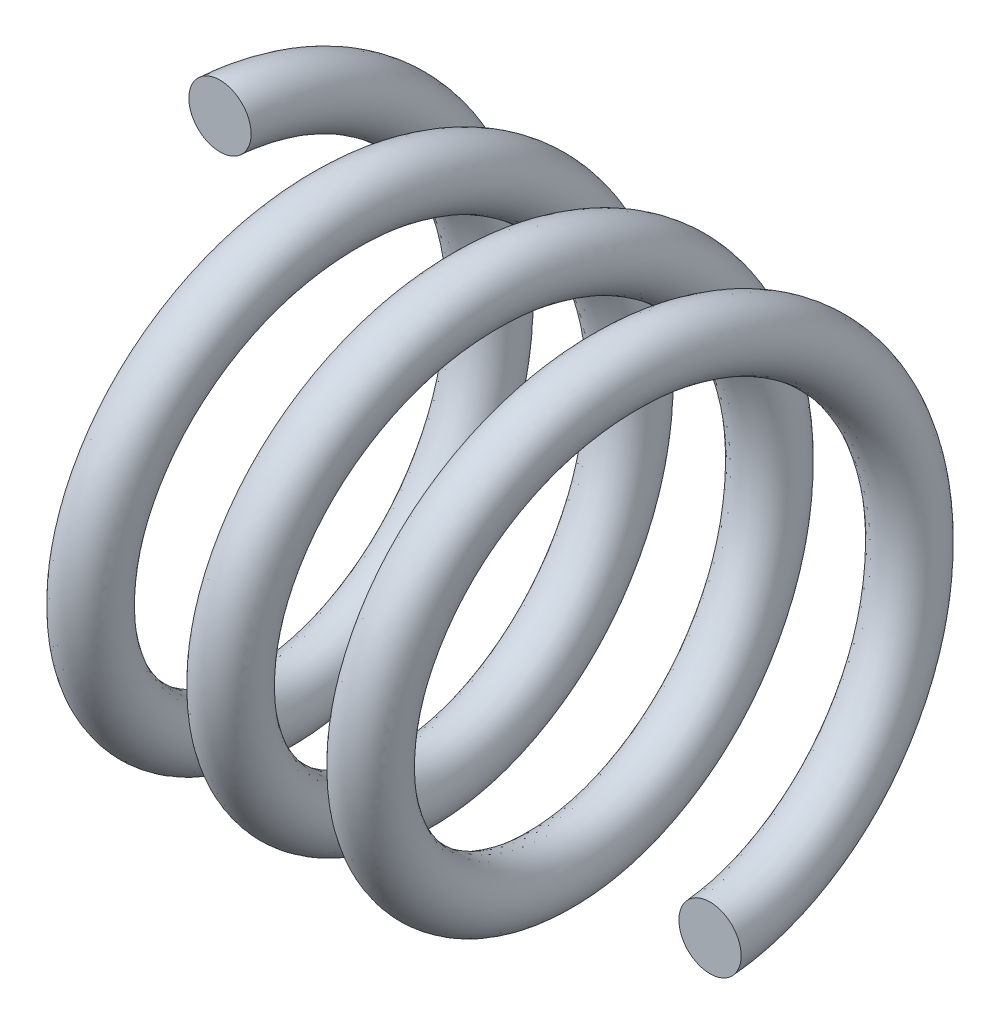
ISO-10303-21;
HEADER;
FILE_DESCRIPTION(('STEP AP214'),'2;1');
FILE_NAME('part.step','',(''),(''),'','','');
FILE_SCHEMA(('AUTOMOTIVE_DESIGN { 1 0 10303 214 1 1 1 1 }'));
ENDSEC;
DATA;
#1=APPLICATION_CONTEXT('core data for automotive mechanical design processes');
#2=APPLICATION_PROTOCOL_DEFINITION('international standard','automotive_design',2000,#1);
#3=PRODUCT_CONTEXT('',#1,'mechanical');
#4=PRODUCT('Part','Part','',(#3));
#5=PRODUCT_RELATED_PRODUCT_CATEGORY('part','',(#4));
#6=PRODUCT_DEFINITION_FORMATION('','',#4);
#7=PRODUCT_DEFINITION_CONTEXT('part definition',#1,'design');
#8=PRODUCT_DEFINITION('design','',#6,#7);
#9=PRODUCT_DEFINITION_SHAPE('','',#8);
#10=(LENGTH_UNIT() NAMED_UNIT(*) SI_UNIT(.MILLI.,.METRE.));
#11=(NAMED_UNIT(*) PLANE_ANGLE_UNIT() SI_UNIT($,.RADIAN.));
#12=(NAMED_UNIT(*) SI_UNIT($,.STERADIAN.) SOLID_ANGLE_UNIT());
#13=UNCERTAINTY_MEASURE_WITH_UNIT(LENGTH_MEASURE(1.E-05),#10,'distance_accuracy_value','');
#14=(GEOMETRIC_REPRESENTATION_CONTEXT(3) GLOBAL_UNCERTAINTY_ASSIGNED_CONTEXT((#13)) GLOBAL_UNIT_ASSIGNED_CONTEXT((#10,
#11,#12)) REPRESENTATION_CONTEXT('',''));
#15=CARTESIAN_POINT('',(0.,0.,0.));
#16=DIRECTION('',(0.,0.,1.));
#17=DIRECTION('',(1.,0.,0.));
#18=AXIS2_PLACEMENT_3D('',#15,#16,#17);
#19=CARTESIAN_POINT('',(-1.,7.5,0.));
#20=DIRECTION('',(0.,0.,-1.));
#21=DIRECTION('',(-1.,0.,0.));
#22=AXIS2_PLACEMENT_3D('',#19,#20,#21);
#23=PLANE('',#22);
#24=CARTESIAN_POINT('',(1.,7.5,0.));
#25=CARTESIAN_POINT('',(1.,7.23841681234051,0.));
#26=CARTESIAN_POINT('',(0.849527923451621,6.5,0.));
#27=CARTESIAN_POINT('',(-0.849527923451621,6.5,0.));
#28=CARTESIAN_POINT('',(-1.,7.23841681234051,0.));
#29=CARTESIAN_POINT('',(-1.,7.76158318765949,0.));
#30=CARTESIAN_POINT('',(-0.849527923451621,8.5,0.));
#31=CARTESIAN_POINT('',(0.849527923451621,8.5,0.));
#32=CARTESIAN_POINT('',(1.,7.76158318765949,0.));
#33=CARTESIAN_POINT('',(1.,7.5,0.));
#34=(BOUNDED_CURVE() B_SPLINE_CURVE(3,(#24,#25,#26,#27,#28,#29,#30,#31,#32,#33),.UNSPECIFIED.,
.T.,.F.) B_SPLINE_CURVE_WITH_KNOTS((4,2,2,2,4),(0.,0.25,0.5,0.75,1.),
.UNSPECIFIED.) CURVE() GEOMETRIC_REPRESENTATION_ITEM() RATIONAL_B_SPLINE_CURVE((1.,1.,
0.68211091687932,0.68211091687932,1.,1.,0.68211091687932,0.68211091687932,1.,1.)) REPRESENTATION_ITEM(''));
#35=CARTESIAN_POINT('',(1.,7.5,0.));
#36=VERTEX_POINT('',#35);
#37=EDGE_CURVE('E359',#36,#36,#34,.F.);
#38=ORIENTED_EDGE('',*,*,#37,.T.);
#39=EDGE_LOOP('',(#38));
#40=FACE_BOUND('',#39,.T.);
#41=ADVANCED_FACE('F348',(#40),#23,.F.);
#42=CARTESIAN_POINT('',(14.75,-7.5,0.));
#43=DIRECTION('',(0.,0.,1.));
#44=DIRECTION('',(0.,-1.,0.));
#45=AXIS2_PLACEMENT_3D('',#42,#43,#44);
#46=PLANE('',#45);
#47=CARTESIAN_POINT('',(16.75,-7.5,0.));
#48=CARTESIAN_POINT('',(16.75,-7.76158318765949,0.));
#49=CARTESIAN_POINT('',(16.5995279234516,-8.5,0.));
#50=CARTESIAN_POINT('',(14.9004720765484,-8.5,0.));
#51=CARTESIAN_POINT('',(14.75,-7.76158318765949,0.));
#52=CARTESIAN_POINT('',(14.75,-7.23841681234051,0.));
#53=CARTESIAN_POINT('',(14.9004720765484,-6.5,0.));
#54=CARTESIAN_POINT('',(16.5995279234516,-6.5,0.));
#55=CARTESIAN_POINT('',(16.75,-7.23841681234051,0.));
#56=CARTESIAN_POINT('',(16.75,-7.5,0.));
#57=(BOUNDED_CURVE() B_SPLINE_CURVE(3,(#47,#48,#49,#50,#51,#52,#53,#54,#55,#56),.UNSPECIFIED.,
.T.,.F.) B_SPLINE_CURVE_WITH_KNOTS((4,2,2,2,4),(0.,0.25,0.5,0.75,1.),
.UNSPECIFIED.) CURVE() GEOMETRIC_REPRESENTATION_ITEM() RATIONAL_B_SPLINE_CURVE((1.,1.,
0.68211091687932,0.68211091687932,1.,1.,0.68211091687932,0.68211091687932,1.,1.)) REPRESENTATION_ITEM(''));
#58=CARTESIAN_POINT('',(16.75,-7.5,0.));
#59=VERTEX_POINT('',#58);
#60=EDGE_CURVE('E10',#59,#59,#57,.F.);
#61=ORIENTED_EDGE('',*,*,#60,.T.);
#62=EDGE_LOOP('',(#61));
#63=FACE_BOUND('',#62,.T.);
#64=ADVANCED_FACE('F350',(#63),#46,.T.);
#65=CARTESIAN_POINT('',(1.,7.5,0.));
#66=CARTESIAN_POINT('',(1.1875,7.5,-2.00961894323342));
#67=CARTESIAN_POINT('',(1.375,6.49519052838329,-3.75));
#68=CARTESIAN_POINT('',(1.5625,5.49038105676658,-5.49038105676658));
#69=CARTESIAN_POINT('',(1.75,3.75,-6.49519052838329));
#70=CARTESIAN_POINT('',(1.9375,2.00961894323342,-7.5));
#71=CARTESIAN_POINT('',(2.125,0.,-7.5));
#72=CARTESIAN_POINT('',(2.3125,-2.00961894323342,-7.5));
#73=CARTESIAN_POINT('',(2.5,-3.75,-6.49519052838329));
#74=CARTESIAN_POINT('',(2.6875,-5.49038105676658,-5.49038105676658));
#75=CARTESIAN_POINT('',(2.875,-6.49519052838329,-3.75));
#76=CARTESIAN_POINT('',(3.0625,-7.5,-2.00961894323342));
#77=CARTESIAN_POINT('',(3.25,-7.5,0.));
#78=CARTESIAN_POINT('',(3.4375,-7.5,2.00961894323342));
#79=CARTESIAN_POINT('',(3.625,-6.49519052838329,3.75));
#80=CARTESIAN_POINT('',(3.8125,-5.49038105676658,5.49038105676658));
#81=CARTESIAN_POINT('',(4.,-3.75,6.49519052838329));
#82=CARTESIAN_POINT('',(4.1875,-2.00961894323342,7.5));
#83=CARTESIAN_POINT('',(4.375,0.,7.5));
#84=CARTESIAN_POINT('',(4.5625,2.00961894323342,7.5));
#85=CARTESIAN_POINT('',(4.75,3.75,6.49519052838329));
#86=CARTESIAN_POINT('',(4.9375,5.49038105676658,5.49038105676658));
#87=CARTESIAN_POINT('',(5.125,6.49519052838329,3.75));
#88=CARTESIAN_POINT('',(5.3125,7.5,2.00961894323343));
#89=CARTESIAN_POINT('',(5.5,7.5,0.));
#90=CARTESIAN_POINT('',(5.6875,7.5,-2.00961894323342));
#91=CARTESIAN_POINT('',(5.875,6.49519052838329,-3.75));
#92=CARTESIAN_POINT('',(6.0625,5.49038105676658,-5.49038105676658));
#93=CARTESIAN_POINT('',(6.25,3.75,-6.49519052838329));
#94=CARTESIAN_POINT('',(6.4375,2.00961894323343,-7.5));
#95=CARTESIAN_POINT('',(6.625,0.,-7.5));
#96=CARTESIAN_POINT('',(6.8125,-2.00961894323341,-7.5));
#97=CARTESIAN_POINT('',(7.,-3.74999999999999,-6.49519052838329));
#98=CARTESIAN_POINT('',(7.1875,-5.49038105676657,-5.49038105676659));
#99=CARTESIAN_POINT('',(7.375,-6.49519052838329,-3.75000000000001));
#100=CARTESIAN_POINT('',(7.5625,-7.5,-2.00961894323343));
#101=CARTESIAN_POINT('',(7.75,-7.5,0.));
#102=CARTESIAN_POINT('',(7.9375,-7.5,2.00961894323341));
#103=CARTESIAN_POINT('',(8.125,-6.49519052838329,3.74999999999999));
#104=CARTESIAN_POINT('',(8.3125,-5.49038105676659,5.49038105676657));
#105=CARTESIAN_POINT('',(8.5,-3.75000000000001,6.49519052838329));
#106=CARTESIAN_POINT('',(8.6875,-2.00961894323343,7.5));
#107=CARTESIAN_POINT('',(8.875,0.,7.5));
#108=CARTESIAN_POINT('',(9.0625,2.00961894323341,7.5));
#109=CARTESIAN_POINT('',(9.25,3.74999999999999,6.4951905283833));
#110=CARTESIAN_POINT('',(9.4375,5.49038105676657,5.49038105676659));
#111=CARTESIAN_POINT('',(9.625,6.49519052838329,3.75000000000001));
#112=CARTESIAN_POINT('',(9.8125,7.5,2.00961894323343));
#113=CARTESIAN_POINT('',(10.,7.5,0.));
#114=CARTESIAN_POINT('',(10.1875,7.5,-2.00961894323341));
#115=CARTESIAN_POINT('',(10.375,6.4951905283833,-3.74999999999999));
#116=CARTESIAN_POINT('',(10.5625,5.49038105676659,-5.49038105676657));
#117=CARTESIAN_POINT('',(10.75,3.75000000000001,-6.49519052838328));
#118=CARTESIAN_POINT('',(10.9375,2.00961894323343,-7.5));
#119=CARTESIAN_POINT('',(11.125,0.,-7.5));
#120=CARTESIAN_POINT('',(11.3125,-2.00961894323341,-7.5));
#121=CARTESIAN_POINT('',(11.5,-3.74999999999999,-6.4951905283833));
#122=CARTESIAN_POINT('',(11.6875,-5.49038105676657,-5.49038105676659));
#123=CARTESIAN_POINT('',(11.875,-6.49519052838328,-3.75000000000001));
#124=CARTESIAN_POINT('',(12.0625,-7.5,-2.00961894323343));
#125=CARTESIAN_POINT('',(12.25,-7.5,0.));
#126=CARTESIAN_POINT('',(12.4375,-7.5,2.00961894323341));
#127=CARTESIAN_POINT('',(12.625,-6.4951905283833,3.74999999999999));
#128=CARTESIAN_POINT('',(12.8125,-5.49038105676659,5.49038105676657));
#129=CARTESIAN_POINT('',(13.,-3.75000000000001,6.49519052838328));
#130=CARTESIAN_POINT('',(13.1875,-2.00961894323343,7.5));
#131=CARTESIAN_POINT('',(13.375,0.,7.5));
#132=CARTESIAN_POINT('',(13.5625,2.00961894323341,7.5));
#133=CARTESIAN_POINT('',(13.75,3.74999999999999,6.4951905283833));
#134=CARTESIAN_POINT('',(13.9375,5.49038105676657,5.49038105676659));
#135=CARTESIAN_POINT('',(14.125,6.49519052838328,3.75000000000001));
#136=CARTESIAN_POINT('',(14.3125,7.5,2.00961894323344));
#137=CARTESIAN_POINT('',(14.5,7.5,0.));
#138=CARTESIAN_POINT('',(14.6875,7.5,-2.0096189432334));
#139=CARTESIAN_POINT('',(14.875,6.4951905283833,-3.74999999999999));
#140=CARTESIAN_POINT('',(15.0625,5.49038105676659,-5.49038105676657));
#141=CARTESIAN_POINT('',(15.25,3.75000000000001,-6.49519052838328));
#142=CARTESIAN_POINT('',(15.4375,2.00961894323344,-7.5));
#143=CARTESIAN_POINT('',(15.625,0.,-7.5));
#144=CARTESIAN_POINT('',(15.8125,-2.0096189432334,-7.5));
#145=CARTESIAN_POINT('',(16.,-3.74999999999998,-6.4951905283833));
#146=CARTESIAN_POINT('',(16.1875,-5.49038105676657,-5.49038105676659));
#147=CARTESIAN_POINT('',(16.375,-6.49519052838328,-3.75000000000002));
#148=CARTESIAN_POINT('',(16.5625,-7.49999999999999,-2.00961894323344));
#149=CARTESIAN_POINT('',(16.75,-7.5,0.));
#150=CARTESIAN_POINT('',(1.,7.76158318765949,0.));
#151=CARTESIAN_POINT('',(1.1875,7.76158318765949,-2.07970994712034));
#152=CARTESIAN_POINT('',(1.375,6.72172821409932,-3.88079159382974));
#153=CARTESIAN_POINT('',(1.5625,5.68187324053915,-5.68187324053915));
#154=CARTESIAN_POINT('',(1.75,3.88079159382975,-6.72172821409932));
#155=CARTESIAN_POINT('',(1.9375,2.07970994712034,-7.76158318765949));
#156=CARTESIAN_POINT('',(2.125,0.,-7.76158318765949));
#157=CARTESIAN_POINT('',(2.3125,-2.07970994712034,-7.76158318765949));
#158=CARTESIAN_POINT('',(2.5,-3.88079159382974,-6.72172821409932));
#159=CARTESIAN_POINT('',(2.6875,-5.68187324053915,-5.68187324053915));
#160=CARTESIAN_POINT('',(2.875,-6.72172821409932,-3.88079159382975));
#161=CARTESIAN_POINT('',(3.0625,-7.76158318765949,-2.07970994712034));
#162=CARTESIAN_POINT('',(3.25,-7.76158318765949,0.));
#163=CARTESIAN_POINT('',(3.4375,-7.76158318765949,2.07970994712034));
#164=CARTESIAN_POINT('',(3.625,-6.72172821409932,3.88079159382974));
#165=CARTESIAN_POINT('',(3.8125,-5.68187324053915,5.68187324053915));
#166=CARTESIAN_POINT('',(4.,-3.88079159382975,6.72172821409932));
#167=CARTESIAN_POINT('',(4.1875,-2.07970994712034,7.76158318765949));
#168=CARTESIAN_POINT('',(4.375,0.,7.76158318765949));
#169=CARTESIAN_POINT('',(4.5625,2.07970994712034,7.76158318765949));
#170=CARTESIAN_POINT('',(4.75,3.88079159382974,6.72172821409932));
#171=CARTESIAN_POINT('',(4.9375,5.68187324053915,5.68187324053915));
#172=CARTESIAN_POINT('',(5.125,6.72172821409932,3.88079159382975));
#173=CARTESIAN_POINT('',(5.3125,7.76158318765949,2.07970994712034));
#174=CARTESIAN_POINT('',(5.5,7.76158318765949,0.));
#175=CARTESIAN_POINT('',(5.6875,7.76158318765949,-2.07970994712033));
#176=CARTESIAN_POINT('',(5.875,6.72172821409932,-3.88079159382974));
#177=CARTESIAN_POINT('',(6.0625,5.68187324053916,-5.68187324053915));
#178=CARTESIAN_POINT('',(6.25,3.88079159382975,-6.72172821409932));
#179=CARTESIAN_POINT('',(6.4375,2.07970994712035,-7.76158318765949));
#180=CARTESIAN_POINT('',(6.625,0.,-7.76158318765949));
#181=CARTESIAN_POINT('',(6.8125,-2.07970994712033,-7.76158318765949));
#182=CARTESIAN_POINT('',(7.,-3.88079159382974,-6.72172821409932));
#183=CARTESIAN_POINT('',(7.1875,-5.68187324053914,-5.68187324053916));
#184=CARTESIAN_POINT('',(7.375,-6.72172821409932,-3.88079159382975));
#185=CARTESIAN_POINT('',(7.5625,-7.76158318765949,-2.07970994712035));
#186=CARTESIAN_POINT('',(7.75,-7.76158318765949,0.));
#187=CARTESIAN_POINT('',(7.9375,-7.76158318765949,2.07970994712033));
#188=CARTESIAN_POINT('',(8.125,-6.72172821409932,3.88079159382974));
#189=CARTESIAN_POINT('',(8.3125,-5.68187324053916,5.68187324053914));
#190=CARTESIAN_POINT('',(8.5,-3.88079159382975,6.72172821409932));
#191=CARTESIAN_POINT('',(8.6875,-2.07970994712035,7.76158318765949));
#192=CARTESIAN_POINT('',(8.875,0.,7.76158318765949));
#193=CARTESIAN_POINT('',(9.0625,2.07970994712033,7.76158318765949));
#194=CARTESIAN_POINT('',(9.25,3.88079159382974,6.72172821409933));
#195=CARTESIAN_POINT('',(9.4375,5.68187324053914,5.68187324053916));
#196=CARTESIAN_POINT('',(9.625,6.72172821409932,3.88079159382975));
#197=CARTESIAN_POINT('',(9.8125,7.76158318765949,2.07970994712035));
#198=CARTESIAN_POINT('',(10.,7.76158318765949,0.));
#199=CARTESIAN_POINT('',(10.1875,7.76158318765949,-2.07970994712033));
#200=CARTESIAN_POINT('',(10.375,6.72172821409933,-3.88079159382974));
#201=CARTESIAN_POINT('',(10.5625,5.68187324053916,-5.68187324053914));
#202=CARTESIAN_POINT('',(10.75,3.88079159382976,-6.72172821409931));
#203=CARTESIAN_POINT('',(10.9375,2.07970994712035,-7.76158318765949));
#204=CARTESIAN_POINT('',(11.125,0.,-7.76158318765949));
#205=CARTESIAN_POINT('',(11.3125,-2.07970994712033,-7.76158318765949));
#206=CARTESIAN_POINT('',(11.5,-3.88079159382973,-6.72172821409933));
#207=CARTESIAN_POINT('',(11.6875,-5.68187324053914,-5.68187324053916));
#208=CARTESIAN_POINT('',(11.875,-6.72172821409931,-3.88079159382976));
#209=CARTESIAN_POINT('',(12.0625,-7.76158318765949,-2.07970994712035));
#210=CARTESIAN_POINT('',(12.25,-7.76158318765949,0.));
#211=CARTESIAN_POINT('',(12.4375,-7.76158318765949,2.07970994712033));
#212=CARTESIAN_POINT('',(12.625,-6.72172821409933,3.88079159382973));
#213=CARTESIAN_POINT('',(12.8125,-5.68187324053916,5.68187324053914));
#214=CARTESIAN_POINT('',(13.,-3.88079159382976,6.72172821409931));
#215=CARTESIAN_POINT('',(13.1875,-2.07970994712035,7.76158318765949));
#216=CARTESIAN_POINT('',(13.375,0.,7.76158318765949));
#217=CARTESIAN_POINT('',(13.5625,2.07970994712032,7.76158318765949));
#218=CARTESIAN_POINT('',(13.75,3.88079159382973,6.72172821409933));
#219=CARTESIAN_POINT('',(13.9375,5.68187324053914,5.68187324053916));
#220=CARTESIAN_POINT('',(14.125,6.72172821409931,3.88079159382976));
#221=CARTESIAN_POINT('',(14.3125,7.76158318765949,2.07970994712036));
#222=CARTESIAN_POINT('',(14.5,7.76158318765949,0.));
#223=CARTESIAN_POINT('',(14.6875,7.76158318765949,-2.07970994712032));
#224=CARTESIAN_POINT('',(14.875,6.72172821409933,-3.88079159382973));
#225=CARTESIAN_POINT('',(15.0625,5.68187324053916,-5.68187324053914));
#226=CARTESIAN_POINT('',(15.25,3.88079159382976,-6.72172821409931));
#227=CARTESIAN_POINT('',(15.4375,2.07970994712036,-7.76158318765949));
#228=CARTESIAN_POINT('',(15.625,0.,-7.76158318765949));
#229=CARTESIAN_POINT('',(15.8125,-2.07970994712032,-7.76158318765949));
#230=CARTESIAN_POINT('',(16.,-3.88079159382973,-6.72172821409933));
#231=CARTESIAN_POINT('',(16.1875,-5.68187324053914,-5.68187324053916));
#232=CARTESIAN_POINT('',(16.375,-6.72172821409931,-3.88079159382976));
#233=CARTESIAN_POINT('',(16.5625,-7.76158318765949,-2.07970994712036));
#234=CARTESIAN_POINT('',(16.75,-7.76158318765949,0.));
#235=CARTESIAN_POINT('',(0.849527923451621,8.5,0.));
#236=CARTESIAN_POINT('',(1.03702792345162,8.5,-2.27756813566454));
#237=CARTESIAN_POINT('',(1.22452792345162,7.36121593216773,-4.25));
#238=CARTESIAN_POINT('',(1.41202792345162,6.22243186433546,-6.22243186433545));
#239=CARTESIAN_POINT('',(1.59952792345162,4.25,-7.36121593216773));
#240=CARTESIAN_POINT('',(1.78702792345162,2.27756813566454,-8.5));
#241=CARTESIAN_POINT('',(1.97452792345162,0.,-8.5));
#242=CARTESIAN_POINT('',(2.16202792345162,-2.27756813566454,-8.5));
#243=CARTESIAN_POINT('',(2.34952792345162,-4.25,-7.36121593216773));
#244=CARTESIAN_POINT('',(2.53702792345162,-6.22243186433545,-6.22243186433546));
#245=CARTESIAN_POINT('',(2.72452792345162,-7.36121593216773,-4.25));
#246=CARTESIAN_POINT('',(2.91202792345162,-8.49999999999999,-2.27756813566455));
#247=CARTESIAN_POINT('',(3.09952792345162,-8.5,0.));
#248=CARTESIAN_POINT('',(3.28702792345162,-8.5,2.27756813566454));
#249=CARTESIAN_POINT('',(3.47452792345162,-7.36121593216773,4.25));
#250=CARTESIAN_POINT('',(3.66202792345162,-6.22243186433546,6.22243186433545));
#251=CARTESIAN_POINT('',(3.84952792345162,-4.25,7.36121593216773));
#252=CARTESIAN_POINT('',(4.03702792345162,-2.27756813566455,8.49999999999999));
#253=CARTESIAN_POINT('',(4.22452792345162,0.,8.5));
#254=CARTESIAN_POINT('',(4.41202792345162,2.27756813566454,8.5));
#255=CARTESIAN_POINT('',(4.59952792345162,4.24999999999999,7.36121593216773));
#256=CARTESIAN_POINT('',(4.78702792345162,6.22243186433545,6.22243186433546));
#257=CARTESIAN_POINT('',(4.97452792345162,7.36121593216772,4.25));
#258=CARTESIAN_POINT('',(5.16202792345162,8.49999999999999,2.27756813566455));
#259=CARTESIAN_POINT('',(5.34952792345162,8.5,0.));
#260=CARTESIAN_POINT('',(5.53702792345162,8.5,-2.27756813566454));
#261=CARTESIAN_POINT('',(5.72452792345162,7.36121593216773,-4.24999999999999));
#262=CARTESIAN_POINT('',(5.91202792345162,6.22243186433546,-6.22243186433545));
#263=CARTESIAN_POINT('',(6.09952792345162,4.25000000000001,-7.36121593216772));
#264=CARTESIAN_POINT('',(6.28702792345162,2.27756813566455,-8.49999999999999));
#265=CARTESIAN_POINT('',(6.47452792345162,0.,-8.5));
#266=CARTESIAN_POINT('',(6.66202792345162,-2.27756813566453,-8.5));
#267=CARTESIAN_POINT('',(6.84952792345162,-4.24999999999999,-7.36121593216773));
#268=CARTESIAN_POINT('',(7.03702792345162,-6.22243186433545,-6.22243186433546));
#269=CARTESIAN_POINT('',(7.22452792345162,-7.36121593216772,-4.25000000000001));
#270=CARTESIAN_POINT('',(7.41202792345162,-8.49999999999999,-2.27756813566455));
#271=CARTESIAN_POINT('',(7.59952792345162,-8.5,0.));
#272=CARTESIAN_POINT('',(7.78702792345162,-8.5,2.27756813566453));
#273=CARTESIAN_POINT('',(7.97452792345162,-7.36121593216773,4.24999999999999));
#274=CARTESIAN_POINT('',(8.16202792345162,-6.22243186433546,6.22243186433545));
#275=CARTESIAN_POINT('',(8.34952792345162,-4.25000000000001,7.36121593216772));
#276=CARTESIAN_POINT('',(8.53702792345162,-2.27756813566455,8.49999999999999));
#277=CARTESIAN_POINT('',(8.72452792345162,0.,8.5));
#278=CARTESIAN_POINT('',(8.91202792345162,2.27756813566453,8.5));
#279=CARTESIAN_POINT('',(9.09952792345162,4.24999999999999,7.36121593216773));
#280=CARTESIAN_POINT('',(9.28702792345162,6.22243186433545,6.22243186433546));
#281=CARTESIAN_POINT('',(9.47452792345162,7.36121593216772,4.25000000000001));
#282=CARTESIAN_POINT('',(9.66202792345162,8.49999999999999,2.27756813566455));
#283=CARTESIAN_POINT('',(9.84952792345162,8.5,0.));
#284=CARTESIAN_POINT('',(10.0370279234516,8.5,-2.27756813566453));
#285=CARTESIAN_POINT('',(10.2245279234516,7.36121593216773,-4.24999999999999));
#286=CARTESIAN_POINT('',(10.4120279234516,6.22243186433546,-6.22243186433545));
#287=CARTESIAN_POINT('',(10.5995279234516,4.25000000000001,-7.36121593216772));
#288=CARTESIAN_POINT('',(10.7870279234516,2.27756813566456,-8.49999999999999));
#289=CARTESIAN_POINT('',(10.9745279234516,0.,-8.5));
#290=CARTESIAN_POINT('',(11.1620279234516,-2.27756813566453,-8.5));
#291=CARTESIAN_POINT('',(11.3495279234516,-4.24999999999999,-7.36121593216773));
#292=CARTESIAN_POINT('',(11.5370279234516,-6.22243186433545,-6.22243186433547));
#293=CARTESIAN_POINT('',(11.7245279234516,-7.36121593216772,-4.25000000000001));
#294=CARTESIAN_POINT('',(11.9120279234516,-8.49999999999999,-2.27756813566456));
#295=CARTESIAN_POINT('',(12.0995279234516,-8.5,0.));
#296=CARTESIAN_POINT('',(12.2870279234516,-8.5,2.27756813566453));
#297=CARTESIAN_POINT('',(12.4745279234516,-7.36121593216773,4.24999999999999));
#298=CARTESIAN_POINT('',(12.6620279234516,-6.22243186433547,6.22243186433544));
#299=CARTESIAN_POINT('',(12.8495279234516,-4.25000000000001,7.36121593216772));
#300=CARTESIAN_POINT('',(13.0370279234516,-2.27756813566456,8.49999999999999));
#301=CARTESIAN_POINT('',(13.2245279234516,0.,8.5));
#302=CARTESIAN_POINT('',(13.4120279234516,2.27756813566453,8.5));
#303=CARTESIAN_POINT('',(13.5995279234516,4.24999999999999,7.36121593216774));
#304=CARTESIAN_POINT('',(13.7870279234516,6.22243186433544,6.22243186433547));
#305=CARTESIAN_POINT('',(13.9745279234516,7.36121593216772,4.25000000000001));
#306=CARTESIAN_POINT('',(14.1620279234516,8.49999999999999,2.27756813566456));
#307=CARTESIAN_POINT('',(14.3495279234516,8.5,0.));
#308=CARTESIAN_POINT('',(14.5370279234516,8.5,-2.27756813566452));
#309=CARTESIAN_POINT('',(14.7245279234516,7.36121593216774,-4.24999999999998));
#310=CARTESIAN_POINT('',(14.9120279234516,6.22243186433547,-6.22243186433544));
#311=CARTESIAN_POINT('',(15.0995279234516,4.25000000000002,-7.36121593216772));
#312=CARTESIAN_POINT('',(15.2870279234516,2.27756813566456,-8.49999999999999));
#313=CARTESIAN_POINT('',(15.4745279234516,0.,-8.5));
#314=CARTESIAN_POINT('',(15.6620279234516,-2.27756813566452,-8.5));
#315=CARTESIAN_POINT('',(15.8495279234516,-4.24999999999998,-7.36121593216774));
#316=CARTESIAN_POINT('',(16.0370279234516,-6.22243186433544,-6.22243186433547));
#317=CARTESIAN_POINT('',(16.2245279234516,-7.36121593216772,-4.25000000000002));
#318=CARTESIAN_POINT('',(16.4120279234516,-8.49999999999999,-2.27756813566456));
#319=CARTESIAN_POINT('',(16.5995279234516,-8.5,0.));
#320=CARTESIAN_POINT('',(-0.849527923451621,8.5,0.));
#321=CARTESIAN_POINT('',(-0.662027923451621,8.5,-2.27756813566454));
#322=CARTESIAN_POINT('',(-0.474527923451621,7.36121593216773,-4.25));
#323=CARTESIAN_POINT('',(-0.287027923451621,6.22243186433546,-6.22243186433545));
#324=CARTESIAN_POINT('',(-0.0995279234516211,4.25,-7.36121593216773));
#325=CARTESIAN_POINT('',(0.0879720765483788,2.27756813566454,-8.5));
#326=CARTESIAN_POINT('',(0.275472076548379,0.,-8.5));
#327=CARTESIAN_POINT('',(0.462972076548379,-2.27756813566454,-8.5));
#328=CARTESIAN_POINT('',(0.650472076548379,-4.25,-7.36121593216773));
#329=CARTESIAN_POINT('',(0.837972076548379,-6.22243186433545,-6.22243186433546));
#330=CARTESIAN_POINT('',(1.02547207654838,-7.36121593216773,-4.25));
#331=CARTESIAN_POINT('',(1.21297207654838,-8.49999999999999,-2.27756813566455));
#332=CARTESIAN_POINT('',(1.40047207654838,-8.5,0.));
#333=CARTESIAN_POINT('',(1.58797207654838,-8.5,2.27756813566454));
#334=CARTESIAN_POINT('',(1.77547207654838,-7.36121593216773,4.25));
#335=CARTESIAN_POINT('',(1.96297207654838,-6.22243186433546,6.22243186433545));
#336=CARTESIAN_POINT('',(2.15047207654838,-4.25,7.36121593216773));
#337=CARTESIAN_POINT('',(2.33797207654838,-2.27756813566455,8.49999999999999));
#338=CARTESIAN_POINT('',(2.52547207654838,0.,8.5));
#339=CARTESIAN_POINT('',(2.71297207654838,2.27756813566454,8.5));
#340=CARTESIAN_POINT('',(2.90047207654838,4.24999999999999,7.36121593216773));
#341=CARTESIAN_POINT('',(3.08797207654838,6.22243186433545,6.22243186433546));
#342=CARTESIAN_POINT('',(3.27547207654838,7.36121593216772,4.25));
#343=CARTESIAN_POINT('',(3.46297207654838,8.49999999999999,2.27756813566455));
#344=CARTESIAN_POINT('',(3.65047207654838,8.5,0.));
#345=CARTESIAN_POINT('',(3.83797207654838,8.5,-2.27756813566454));
#346=CARTESIAN_POINT('',(4.02547207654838,7.36121593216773,-4.24999999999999));
#347=CARTESIAN_POINT('',(4.21297207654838,6.22243186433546,-6.22243186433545));
#348=CARTESIAN_POINT('',(4.40047207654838,4.25000000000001,-7.36121593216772));
#349=CARTESIAN_POINT('',(4.58797207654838,2.27756813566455,-8.49999999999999));
#350=CARTESIAN_POINT('',(4.77547207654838,0.,-8.5));
#351=CARTESIAN_POINT('',(4.96297207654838,-2.27756813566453,-8.5));
#352=CARTESIAN_POINT('',(5.15047207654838,-4.24999999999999,-7.36121593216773));
#353=CARTESIAN_POINT('',(5.33797207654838,-6.22243186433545,-6.22243186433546));
#354=CARTESIAN_POINT('',(5.52547207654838,-7.36121593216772,-4.25000000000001));
#355=CARTESIAN_POINT('',(5.71297207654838,-8.49999999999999,-2.27756813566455));
#356=CARTESIAN_POINT('',(5.90047207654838,-8.5,0.));
#357=CARTESIAN_POINT('',(6.08797207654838,-8.5,2.27756813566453));
#358=CARTESIAN_POINT('',(6.27547207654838,-7.36121593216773,4.24999999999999));
#359=CARTESIAN_POINT('',(6.46297207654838,-6.22243186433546,6.22243186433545));
#360=CARTESIAN_POINT('',(6.65047207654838,-4.25000000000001,7.36121593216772));
#361=CARTESIAN_POINT('',(6.83797207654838,-2.27756813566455,8.49999999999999));
#362=CARTESIAN_POINT('',(7.02547207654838,0.,8.5));
#363=CARTESIAN_POINT('',(7.21297207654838,2.27756813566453,8.5));
#364=CARTESIAN_POINT('',(7.40047207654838,4.24999999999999,7.36121593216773));
#365=CARTESIAN_POINT('',(7.58797207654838,6.22243186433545,6.22243186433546));
#366=CARTESIAN_POINT('',(7.77547207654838,7.36121593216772,4.25000000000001));
#367=CARTESIAN_POINT('',(7.96297207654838,8.49999999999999,2.27756813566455));
#368=CARTESIAN_POINT('',(8.15047207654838,8.5,0.));
#369=CARTESIAN_POINT('',(8.33797207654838,8.5,-2.27756813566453));
#370=CARTESIAN_POINT('',(8.52547207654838,7.36121593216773,-4.24999999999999));
#371=CARTESIAN_POINT('',(8.71297207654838,6.22243186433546,-6.22243186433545));
#372=CARTESIAN_POINT('',(8.90047207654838,4.25000000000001,-7.36121593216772));
#373=CARTESIAN_POINT('',(9.08797207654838,2.27756813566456,-8.49999999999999));
#374=CARTESIAN_POINT('',(9.27547207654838,0.,-8.5));
#375=CARTESIAN_POINT('',(9.46297207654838,-2.27756813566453,-8.5));
#376=CARTESIAN_POINT('',(9.65047207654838,-4.24999999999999,-7.36121593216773));
#377=CARTESIAN_POINT('',(9.83797207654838,-6.22243186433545,-6.22243186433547));
#378=CARTESIAN_POINT('',(10.0254720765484,-7.36121593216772,-4.25000000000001));
#379=CARTESIAN_POINT('',(10.2129720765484,-8.49999999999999,-2.27756813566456));
#380=CARTESIAN_POINT('',(10.4004720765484,-8.5,0.));
#381=CARTESIAN_POINT('',(10.5879720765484,-8.5,2.27756813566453));
#382=CARTESIAN_POINT('',(10.7754720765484,-7.36121593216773,4.24999999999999));
#383=CARTESIAN_POINT('',(10.9629720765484,-6.22243186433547,6.22243186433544));
#384=CARTESIAN_POINT('',(11.1504720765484,-4.25000000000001,7.36121593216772));
#385=CARTESIAN_POINT('',(11.3379720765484,-2.27756813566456,8.49999999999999));
#386=CARTESIAN_POINT('',(11.5254720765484,0.,8.5));
#387=CARTESIAN_POINT('',(11.7129720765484,2.27756813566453,8.5));
#388=CARTESIAN_POINT('',(11.9004720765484,4.24999999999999,7.36121593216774));
#389=CARTESIAN_POINT('',(12.0879720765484,6.22243186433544,6.22243186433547));
#390=CARTESIAN_POINT('',(12.2754720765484,7.36121593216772,4.25000000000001));
#391=CARTESIAN_POINT('',(12.4629720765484,8.49999999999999,2.27756813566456));
#392=CARTESIAN_POINT('',(12.6504720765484,8.5,0.));
#393=CARTESIAN_POINT('',(12.8379720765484,8.5,-2.27756813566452));
#394=CARTESIAN_POINT('',(13.0254720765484,7.36121593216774,-4.24999999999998));
#395=CARTESIAN_POINT('',(13.2129720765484,6.22243186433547,-6.22243186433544));
#396=CARTESIAN_POINT('',(13.4004720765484,4.25000000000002,-7.36121593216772));
#397=CARTESIAN_POINT('',(13.5879720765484,2.27756813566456,-8.49999999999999));
#398=CARTESIAN_POINT('',(13.7754720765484,0.,-8.5));
#399=CARTESIAN_POINT('',(13.9629720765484,-2.27756813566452,-8.5));
#400=CARTESIAN_POINT('',(14.1504720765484,-4.24999999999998,-7.36121593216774));
#401=CARTESIAN_POINT('',(14.3379720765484,-6.22243186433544,-6.22243186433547));
#402=CARTESIAN_POINT('',(14.5254720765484,-7.36121593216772,-4.25000000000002));
#403=CARTESIAN_POINT('',(14.7129720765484,-8.49999999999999,-2.27756813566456));
#404=CARTESIAN_POINT('',(14.9004720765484,-8.5,0.));
#405=CARTESIAN_POINT('',(-1.,7.76158318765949,0.));
#406=CARTESIAN_POINT('',(-0.8125,7.76158318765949,-2.07970994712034));
#407=CARTESIAN_POINT('',(-0.625,6.72172821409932,-3.88079159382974));
#408=CARTESIAN_POINT('',(-0.4375,5.68187324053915,-5.68187324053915));
#409=CARTESIAN_POINT('',(-0.25,3.88079159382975,-6.72172821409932));
#410=CARTESIAN_POINT('',(-0.0625000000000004,2.07970994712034,-7.76158318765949));
#411=CARTESIAN_POINT('',(0.125,0.,-7.76158318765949));
#412=CARTESIAN_POINT('',(0.3125,-2.07970994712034,-7.76158318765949));
#413=CARTESIAN_POINT('',(0.5,-3.88079159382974,-6.72172821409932));
#414=CARTESIAN_POINT('',(0.6875,-5.68187324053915,-5.68187324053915));
#415=CARTESIAN_POINT('',(0.874999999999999,-6.72172821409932,-3.88079159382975));
#416=CARTESIAN_POINT('',(1.0625,-7.76158318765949,-2.07970994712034));
#417=CARTESIAN_POINT('',(1.25,-7.76158318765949,0.));
#418=CARTESIAN_POINT('',(1.4375,-7.76158318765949,2.07970994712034));
#419=CARTESIAN_POINT('',(1.625,-6.72172821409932,3.88079159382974));
#420=CARTESIAN_POINT('',(1.8125,-5.68187324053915,5.68187324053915));
#421=CARTESIAN_POINT('',(2.,-3.88079159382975,6.72172821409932));
#422=CARTESIAN_POINT('',(2.1875,-2.07970994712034,7.76158318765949));
#423=CARTESIAN_POINT('',(2.375,0.,7.76158318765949));
#424=CARTESIAN_POINT('',(2.5625,2.07970994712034,7.76158318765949));
#425=CARTESIAN_POINT('',(2.75,3.88079159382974,6.72172821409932));
#426=CARTESIAN_POINT('',(2.9375,5.68187324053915,5.68187324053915));
#427=CARTESIAN_POINT('',(3.125,6.72172821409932,3.88079159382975));
#428=CARTESIAN_POINT('',(3.3125,7.76158318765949,2.07970994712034));
#429=CARTESIAN_POINT('',(3.5,7.76158318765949,0.));
#430=CARTESIAN_POINT('',(3.6875,7.76158318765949,-2.07970994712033));
#431=CARTESIAN_POINT('',(3.875,6.72172821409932,-3.88079159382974));
#432=CARTESIAN_POINT('',(4.0625,5.68187324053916,-5.68187324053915));
#433=CARTESIAN_POINT('',(4.25,3.88079159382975,-6.72172821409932));
#434=CARTESIAN_POINT('',(4.4375,2.07970994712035,-7.76158318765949));
#435=CARTESIAN_POINT('',(4.625,0.,-7.76158318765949));
#436=CARTESIAN_POINT('',(4.8125,-2.07970994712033,-7.76158318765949));
#437=CARTESIAN_POINT('',(5.,-3.88079159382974,-6.72172821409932));
#438=CARTESIAN_POINT('',(5.1875,-5.68187324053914,-5.68187324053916));
#439=CARTESIAN_POINT('',(5.375,-6.72172821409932,-3.88079159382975));
#440=CARTESIAN_POINT('',(5.5625,-7.76158318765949,-2.07970994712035));
#441=CARTESIAN_POINT('',(5.75,-7.76158318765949,0.));
#442=CARTESIAN_POINT('',(5.9375,-7.76158318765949,2.07970994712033));
#443=CARTESIAN_POINT('',(6.125,-6.72172821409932,3.88079159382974));
#444=CARTESIAN_POINT('',(6.3125,-5.68187324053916,5.68187324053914));
#445=CARTESIAN_POINT('',(6.5,-3.88079159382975,6.72172821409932));
#446=CARTESIAN_POINT('',(6.6875,-2.07970994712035,7.76158318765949));
#447=CARTESIAN_POINT('',(6.875,0.,7.76158318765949));
#448=CARTESIAN_POINT('',(7.0625,2.07970994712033,7.76158318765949));
#449=CARTESIAN_POINT('',(7.25,3.88079159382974,6.72172821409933));
#450=CARTESIAN_POINT('',(7.4375,5.68187324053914,5.68187324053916));
#451=CARTESIAN_POINT('',(7.625,6.72172821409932,3.88079159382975));
#452=CARTESIAN_POINT('',(7.8125,7.76158318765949,2.07970994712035));
#453=CARTESIAN_POINT('',(8.,7.76158318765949,0.));
#454=CARTESIAN_POINT('',(8.1875,7.76158318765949,-2.07970994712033));
#455=CARTESIAN_POINT('',(8.375,6.72172821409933,-3.88079159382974));
#456=CARTESIAN_POINT('',(8.5625,5.68187324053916,-5.68187324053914));
#457=CARTESIAN_POINT('',(8.75,3.88079159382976,-6.72172821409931));
#458=CARTESIAN_POINT('',(8.9375,2.07970994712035,-7.76158318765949));
#459=CARTESIAN_POINT('',(9.125,0.,-7.76158318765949));
#460=CARTESIAN_POINT('',(9.3125,-2.07970994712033,-7.76158318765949));
#461=CARTESIAN_POINT('',(9.5,-3.88079159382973,-6.72172821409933));
#462=CARTESIAN_POINT('',(9.6875,-5.68187324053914,-5.68187324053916));
#463=CARTESIAN_POINT('',(9.875,-6.72172821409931,-3.88079159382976));
#464=CARTESIAN_POINT('',(10.0625,-7.76158318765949,-2.07970994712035));
#465=CARTESIAN_POINT('',(10.25,-7.76158318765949,0.));
#466=CARTESIAN_POINT('',(10.4375,-7.76158318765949,2.07970994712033));
#467=CARTESIAN_POINT('',(10.625,-6.72172821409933,3.88079159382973));
#468=CARTESIAN_POINT('',(10.8125,-5.68187324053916,5.68187324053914));
#469=CARTESIAN_POINT('',(11.,-3.88079159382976,6.72172821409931));
#470=CARTESIAN_POINT('',(11.1875,-2.07970994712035,7.76158318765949));
#471=CARTESIAN_POINT('',(11.375,0.,7.76158318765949));
#472=CARTESIAN_POINT('',(11.5625,2.07970994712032,7.76158318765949));
#473=CARTESIAN_POINT('',(11.75,3.88079159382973,6.72172821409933));
#474=CARTESIAN_POINT('',(11.9375,5.68187324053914,5.68187324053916));
#475=CARTESIAN_POINT('',(12.125,6.72172821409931,3.88079159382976));
#476=CARTESIAN_POINT('',(12.3125,7.76158318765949,2.07970994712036));
#477=CARTESIAN_POINT('',(12.5,7.76158318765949,0.));
#478=CARTESIAN_POINT('',(12.6875,7.76158318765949,-2.07970994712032));
#479=CARTESIAN_POINT('',(12.875,6.72172821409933,-3.88079159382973));
#480=CARTESIAN_POINT('',(13.0625,5.68187324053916,-5.68187324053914));
#481=CARTESIAN_POINT('',(13.25,3.88079159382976,-6.72172821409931));
#482=CARTESIAN_POINT('',(13.4375,2.07970994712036,-7.76158318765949));
#483=CARTESIAN_POINT('',(13.625,0.,-7.76158318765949));
#484=CARTESIAN_POINT('',(13.8125,-2.07970994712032,-7.76158318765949));
#485=CARTESIAN_POINT('',(14.,-3.88079159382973,-6.72172821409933));
#486=CARTESIAN_POINT('',(14.1875,-5.68187324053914,-5.68187324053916));
#487=CARTESIAN_POINT('',(14.375,-6.72172821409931,-3.88079159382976));
#488=CARTESIAN_POINT('',(14.5625,-7.76158318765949,-2.07970994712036));
#489=CARTESIAN_POINT('',(14.75,-7.76158318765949,0.));
#490=CARTESIAN_POINT('',(-1.,7.23841681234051,0.));
#491=CARTESIAN_POINT('',(-0.8125,7.23841681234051,-1.9395279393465));
#492=CARTESIAN_POINT('',(-0.625,6.26865284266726,-3.61920840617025));
#493=CARTESIAN_POINT('',(-0.4375,5.29888887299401,-5.29888887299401));
#494=CARTESIAN_POINT('',(-0.25,3.61920840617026,-6.26865284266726));
#495=CARTESIAN_POINT('',(-0.0625000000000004,1.9395279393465,-7.23841681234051));
#496=CARTESIAN_POINT('',(0.125,0.,-7.23841681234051));
#497=CARTESIAN_POINT('',(0.3125,-1.9395279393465,-7.23841681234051));
#498=CARTESIAN_POINT('',(0.5,-3.61920840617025,-6.26865284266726));
#499=CARTESIAN_POINT('',(0.6875,-5.29888887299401,-5.29888887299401));
#500=CARTESIAN_POINT('',(0.874999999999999,-6.26865284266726,-3.61920840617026));
#501=CARTESIAN_POINT('',(1.0625,-7.23841681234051,-1.9395279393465));
#502=CARTESIAN_POINT('',(1.25,-7.23841681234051,0.));
#503=CARTESIAN_POINT('',(1.4375,-7.23841681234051,1.9395279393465));
#504=CARTESIAN_POINT('',(1.625,-6.26865284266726,3.61920840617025));
#505=CARTESIAN_POINT('',(1.8125,-5.29888887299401,5.29888887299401));
#506=CARTESIAN_POINT('',(2.,-3.61920840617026,6.26865284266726));
#507=CARTESIAN_POINT('',(2.1875,-1.9395279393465,7.23841681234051));
#508=CARTESIAN_POINT('',(2.375,0.,7.23841681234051));
#509=CARTESIAN_POINT('',(2.5625,1.9395279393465,7.23841681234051));
#510=CARTESIAN_POINT('',(2.75,3.61920840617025,6.26865284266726));
#511=CARTESIAN_POINT('',(2.9375,5.29888887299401,5.29888887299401));
#512=CARTESIAN_POINT('',(3.125,6.26865284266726,3.61920840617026));
#513=CARTESIAN_POINT('',(3.3125,7.23841681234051,1.93952793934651));
#514=CARTESIAN_POINT('',(3.5,7.23841681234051,0.));
#515=CARTESIAN_POINT('',(3.6875,7.23841681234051,-1.9395279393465));
#516=CARTESIAN_POINT('',(3.875,6.26865284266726,-3.61920840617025));
#517=CARTESIAN_POINT('',(4.0625,5.29888887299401,-5.298888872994));
#518=CARTESIAN_POINT('',(4.25,3.61920840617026,-6.26865284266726));
#519=CARTESIAN_POINT('',(4.4375,1.93952793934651,-7.23841681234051));
#520=CARTESIAN_POINT('',(4.625,0.,-7.23841681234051));
#521=CARTESIAN_POINT('',(4.8125,-1.93952793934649,-7.23841681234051));
#522=CARTESIAN_POINT('',(5.,-3.61920840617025,-6.26865284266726));
#523=CARTESIAN_POINT('',(5.1875,-5.298888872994,-5.29888887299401));
#524=CARTESIAN_POINT('',(5.375,-6.26865284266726,-3.61920840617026));
#525=CARTESIAN_POINT('',(5.5625,-7.23841681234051,-1.93952793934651));
#526=CARTESIAN_POINT('',(5.75,-7.23841681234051,0.));
#527=CARTESIAN_POINT('',(5.9375,-7.23841681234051,1.93952793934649));
#528=CARTESIAN_POINT('',(6.125,-6.26865284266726,3.61920840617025));
#529=CARTESIAN_POINT('',(6.3125,-5.29888887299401,5.298888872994));
#530=CARTESIAN_POINT('',(6.5,-3.61920840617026,6.26865284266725));
#531=CARTESIAN_POINT('',(6.6875,-1.93952793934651,7.23841681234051));
#532=CARTESIAN_POINT('',(6.875,0.,7.23841681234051));
#533=CARTESIAN_POINT('',(7.0625,1.93952793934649,7.23841681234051));
#534=CARTESIAN_POINT('',(7.25,3.61920840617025,6.26865284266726));
#535=CARTESIAN_POINT('',(7.4375,5.298888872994,5.29888887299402));
#536=CARTESIAN_POINT('',(7.625,6.26865284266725,3.61920840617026));
#537=CARTESIAN_POINT('',(7.8125,7.23841681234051,1.93952793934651));
#538=CARTESIAN_POINT('',(8.,7.23841681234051,0.));
#539=CARTESIAN_POINT('',(8.1875,7.23841681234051,-1.93952793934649));
#540=CARTESIAN_POINT('',(8.375,6.26865284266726,-3.61920840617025));
#541=CARTESIAN_POINT('',(8.5625,5.29888887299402,-5.298888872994));
#542=CARTESIAN_POINT('',(8.75,3.61920840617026,-6.26865284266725));
#543=CARTESIAN_POINT('',(8.9375,1.93952793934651,-7.23841681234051));
#544=CARTESIAN_POINT('',(9.125,0.,-7.23841681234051));
#545=CARTESIAN_POINT('',(9.3125,-1.93952793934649,-7.23841681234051));
#546=CARTESIAN_POINT('',(9.5,-3.61920840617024,-6.26865284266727));
#547=CARTESIAN_POINT('',(9.6875,-5.298888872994,-5.29888887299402));
#548=CARTESIAN_POINT('',(9.875,-6.26865284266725,-3.61920840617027));
#549=CARTESIAN_POINT('',(10.0625,-7.23841681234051,-1.93952793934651));
#550=CARTESIAN_POINT('',(10.25,-7.23841681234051,0.));
#551=CARTESIAN_POINT('',(10.4375,-7.23841681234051,1.93952793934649));
#552=CARTESIAN_POINT('',(10.625,-6.26865284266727,3.61920840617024));
#553=CARTESIAN_POINT('',(10.8125,-5.29888887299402,5.298888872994));
#554=CARTESIAN_POINT('',(11.,-3.61920840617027,6.26865284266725));
#555=CARTESIAN_POINT('',(11.1875,-1.93952793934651,7.23841681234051));
#556=CARTESIAN_POINT('',(11.375,0.,7.23841681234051));
#557=CARTESIAN_POINT('',(11.5625,1.93952793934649,7.23841681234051));
#558=CARTESIAN_POINT('',(11.75,3.61920840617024,6.26865284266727));
#559=CARTESIAN_POINT('',(11.9375,5.298888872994,5.29888887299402));
#560=CARTESIAN_POINT('',(12.125,6.26865284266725,3.61920840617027));
#561=CARTESIAN_POINT('',(12.3125,7.23841681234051,1.93952793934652));
#562=CARTESIAN_POINT('',(12.5,7.23841681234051,0.));
#563=CARTESIAN_POINT('',(12.6875,7.23841681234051,-1.93952793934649));
#564=CARTESIAN_POINT('',(12.875,6.26865284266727,-3.61920840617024));
#565=CARTESIAN_POINT('',(13.0625,5.29888887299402,-5.298888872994));
#566=CARTESIAN_POINT('',(13.25,3.61920840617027,-6.26865284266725));
#567=CARTESIAN_POINT('',(13.4375,1.93952793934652,-7.23841681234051));
#568=CARTESIAN_POINT('',(13.625,0.,-7.23841681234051));
#569=CARTESIAN_POINT('',(13.8125,-1.93952793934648,-7.23841681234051));
#570=CARTESIAN_POINT('',(14.,-3.61920840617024,-6.26865284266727));
#571=CARTESIAN_POINT('',(14.1875,-5.298888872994,-5.29888887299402));
#572=CARTESIAN_POINT('',(14.375,-6.26865284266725,-3.61920840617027));
#573=CARTESIAN_POINT('',(14.5625,-7.23841681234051,-1.93952793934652));
#574=CARTESIAN_POINT('',(14.75,-7.23841681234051,0.));
#575=CARTESIAN_POINT('',(-0.849527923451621,6.5,0.));
#576=CARTESIAN_POINT('',(-0.662027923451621,6.5,-1.7416697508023));
#577=CARTESIAN_POINT('',(-0.474527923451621,5.62916512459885,-3.25));
#578=CARTESIAN_POINT('',(-0.287027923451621,4.7583302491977,-4.7583302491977));
#579=CARTESIAN_POINT('',(-0.0995279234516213,3.25,-5.62916512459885));
#580=CARTESIAN_POINT('',(0.0879720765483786,1.7416697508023,-6.5));
#581=CARTESIAN_POINT('',(0.275472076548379,0.,-6.5));
#582=CARTESIAN_POINT('',(0.462972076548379,-1.7416697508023,-6.5));
#583=CARTESIAN_POINT('',(0.650472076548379,-3.25,-5.62916512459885));
#584=CARTESIAN_POINT('',(0.837972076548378,-4.7583302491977,-4.7583302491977));
#585=CARTESIAN_POINT('',(1.02547207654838,-5.62916512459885,-3.25));
#586=CARTESIAN_POINT('',(1.21297207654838,-6.5,-1.7416697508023));
#587=CARTESIAN_POINT('',(1.40047207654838,-6.5,0.));
#588=CARTESIAN_POINT('',(1.58797207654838,-6.5,1.74166975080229));
#589=CARTESIAN_POINT('',(1.77547207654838,-5.62916512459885,3.25));
#590=CARTESIAN_POINT('',(1.96297207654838,-4.7583302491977,4.7583302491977));
#591=CARTESIAN_POINT('',(2.15047207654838,-3.25,5.62916512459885));
#592=CARTESIAN_POINT('',(2.33797207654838,-1.7416697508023,6.5));
#593=CARTESIAN_POINT('',(2.52547207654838,0.,6.5));
#594=CARTESIAN_POINT('',(2.71297207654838,1.74166975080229,6.5));
#595=CARTESIAN_POINT('',(2.90047207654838,3.25,5.62916512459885));
#596=CARTESIAN_POINT('',(3.08797207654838,4.7583302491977,4.75833024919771));
#597=CARTESIAN_POINT('',(3.27547207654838,5.62916512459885,3.25));
#598=CARTESIAN_POINT('',(3.46297207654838,6.5,1.7416697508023));
#599=CARTESIAN_POINT('',(3.65047207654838,6.5,0.));
#600=CARTESIAN_POINT('',(3.83797207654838,6.5,-1.74166975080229));
#601=CARTESIAN_POINT('',(4.02547207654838,5.62916512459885,-3.25));
#602=CARTESIAN_POINT('',(4.21297207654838,4.75833024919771,-4.7583302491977));
#603=CARTESIAN_POINT('',(4.40047207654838,3.25,-5.62916512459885));
#604=CARTESIAN_POINT('',(4.58797207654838,1.7416697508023,-6.5));
#605=CARTESIAN_POINT('',(4.77547207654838,0.,-6.5));
#606=CARTESIAN_POINT('',(4.96297207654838,-1.74166975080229,-6.5));
#607=CARTESIAN_POINT('',(5.15047207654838,-3.25,-5.62916512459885));
#608=CARTESIAN_POINT('',(5.33797207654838,-4.7583302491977,-4.75833024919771));
#609=CARTESIAN_POINT('',(5.52547207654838,-5.62916512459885,-3.25000000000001));
#610=CARTESIAN_POINT('',(5.71297207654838,-6.5,-1.7416697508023));
#611=CARTESIAN_POINT('',(5.90047207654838,-6.5,0.));
#612=CARTESIAN_POINT('',(6.08797207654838,-6.5,1.74166975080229));
#613=CARTESIAN_POINT('',(6.27547207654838,-5.62916512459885,3.24999999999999));
#614=CARTESIAN_POINT('',(6.46297207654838,-4.75833024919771,4.7583302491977));
#615=CARTESIAN_POINT('',(6.65047207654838,-3.25000000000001,5.62916512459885));
#616=CARTESIAN_POINT('',(6.83797207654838,-1.74166975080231,6.5));
#617=CARTESIAN_POINT('',(7.02547207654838,0.,6.5));
#618=CARTESIAN_POINT('',(7.21297207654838,1.74166975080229,6.5));
#619=CARTESIAN_POINT('',(7.40047207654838,3.24999999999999,5.62916512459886));
#620=CARTESIAN_POINT('',(7.58797207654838,4.7583302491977,4.75833024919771));
#621=CARTESIAN_POINT('',(7.77547207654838,5.62916512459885,3.25000000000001));
#622=CARTESIAN_POINT('',(7.96297207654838,6.5,1.74166975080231));
#623=CARTESIAN_POINT('',(8.15047207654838,6.5,0.));
#624=CARTESIAN_POINT('',(8.33797207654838,6.5,-1.74166975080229));
#625=CARTESIAN_POINT('',(8.52547207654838,5.62916512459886,-3.24999999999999));
#626=CARTESIAN_POINT('',(8.71297207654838,4.75833024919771,-4.75833024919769));
#627=CARTESIAN_POINT('',(8.90047207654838,3.25000000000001,-5.62916512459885));
#628=CARTESIAN_POINT('',(9.08797207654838,1.74166975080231,-6.5));
#629=CARTESIAN_POINT('',(9.27547207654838,0.,-6.5));
#630=CARTESIAN_POINT('',(9.46297207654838,-1.74166975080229,-6.5));
#631=CARTESIAN_POINT('',(9.65047207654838,-3.24999999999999,-5.62916512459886));
#632=CARTESIAN_POINT('',(9.83797207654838,-4.75833024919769,-4.75833024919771));
#633=CARTESIAN_POINT('',(10.0254720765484,-5.62916512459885,-3.25000000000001));
#634=CARTESIAN_POINT('',(10.2129720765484,-6.5,-1.74166975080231));
#635=CARTESIAN_POINT('',(10.4004720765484,-6.5,0.));
#636=CARTESIAN_POINT('',(10.5879720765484,-6.5,1.74166975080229));
#637=CARTESIAN_POINT('',(10.7754720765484,-5.62916512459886,3.24999999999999));
#638=CARTESIAN_POINT('',(10.9629720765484,-4.75833024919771,4.75833024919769));
#639=CARTESIAN_POINT('',(11.1504720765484,-3.25000000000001,5.62916512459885));
#640=CARTESIAN_POINT('',(11.3379720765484,-1.74166975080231,6.5));
#641=CARTESIAN_POINT('',(11.5254720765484,0.,6.5));
#642=CARTESIAN_POINT('',(11.7129720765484,1.74166975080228,6.5));
#643=CARTESIAN_POINT('',(11.9004720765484,3.24999999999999,5.62916512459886));
#644=CARTESIAN_POINT('',(12.0879720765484,4.75833024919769,4.75833024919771));
#645=CARTESIAN_POINT('',(12.2754720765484,5.62916512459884,3.25000000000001));
#646=CARTESIAN_POINT('',(12.4629720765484,6.5,1.74166975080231));
#647=CARTESIAN_POINT('',(12.6504720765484,6.5,0.));
#648=CARTESIAN_POINT('',(12.8379720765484,6.5,-1.74166975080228));
#649=CARTESIAN_POINT('',(13.0254720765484,5.62916512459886,-3.24999999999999));
#650=CARTESIAN_POINT('',(13.2129720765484,4.75833024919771,-4.75833024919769));
#651=CARTESIAN_POINT('',(13.4004720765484,3.25000000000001,-5.62916512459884));
#652=CARTESIAN_POINT('',(13.5879720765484,1.74166975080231,-6.49999999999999));
#653=CARTESIAN_POINT('',(13.7754720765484,0.,-6.5));
#654=CARTESIAN_POINT('',(13.9629720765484,-1.74166975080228,-6.5));
#655=CARTESIAN_POINT('',(14.1504720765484,-3.24999999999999,-5.62916512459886));
#656=CARTESIAN_POINT('',(14.3379720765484,-4.75833024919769,-4.75833024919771));
#657=CARTESIAN_POINT('',(14.5254720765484,-5.62916512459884,-3.25000000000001));
#658=CARTESIAN_POINT('',(14.7129720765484,-6.49999999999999,-1.74166975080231));
#659=CARTESIAN_POINT('',(14.9004720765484,-6.5,0.));
#660=CARTESIAN_POINT('',(0.849527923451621,6.5,0.));
#661=CARTESIAN_POINT('',(1.03702792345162,6.5,-1.7416697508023));
#662=CARTESIAN_POINT('',(1.22452792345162,5.62916512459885,-3.25));
#663=CARTESIAN_POINT('',(1.41202792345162,4.7583302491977,-4.7583302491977));
#664=CARTESIAN_POINT('',(1.59952792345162,3.25,-5.62916512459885));
#665=CARTESIAN_POINT('',(1.78702792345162,1.7416697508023,-6.5));
#666=CARTESIAN_POINT('',(1.97452792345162,0.,-6.5));
#667=CARTESIAN_POINT('',(2.16202792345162,-1.7416697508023,-6.5));
#668=CARTESIAN_POINT('',(2.34952792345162,-3.25,-5.62916512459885));
#669=CARTESIAN_POINT('',(2.53702792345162,-4.7583302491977,-4.7583302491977));
#670=CARTESIAN_POINT('',(2.72452792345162,-5.62916512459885,-3.25));
#671=CARTESIAN_POINT('',(2.91202792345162,-6.5,-1.7416697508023));
#672=CARTESIAN_POINT('',(3.09952792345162,-6.5,0.));
#673=CARTESIAN_POINT('',(3.28702792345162,-6.5,1.74166975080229));
#674=CARTESIAN_POINT('',(3.47452792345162,-5.62916512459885,3.25));
#675=CARTESIAN_POINT('',(3.66202792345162,-4.7583302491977,4.7583302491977));
#676=CARTESIAN_POINT('',(3.84952792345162,-3.25,5.62916512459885));
#677=CARTESIAN_POINT('',(4.03702792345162,-1.7416697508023,6.5));
#678=CARTESIAN_POINT('',(4.22452792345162,0.,6.5));
#679=CARTESIAN_POINT('',(4.41202792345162,1.74166975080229,6.5));
#680=CARTESIAN_POINT('',(4.59952792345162,3.25,5.62916512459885));
#681=CARTESIAN_POINT('',(4.78702792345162,4.7583302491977,4.75833024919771));
#682=CARTESIAN_POINT('',(4.97452792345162,5.62916512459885,3.25));
#683=CARTESIAN_POINT('',(5.16202792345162,6.5,1.7416697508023));
#684=CARTESIAN_POINT('',(5.34952792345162,6.5,0.));
#685=CARTESIAN_POINT('',(5.53702792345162,6.5,-1.74166975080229));
#686=CARTESIAN_POINT('',(5.72452792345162,5.62916512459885,-3.25));
#687=CARTESIAN_POINT('',(5.91202792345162,4.75833024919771,-4.7583302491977));
#688=CARTESIAN_POINT('',(6.09952792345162,3.25,-5.62916512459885));
#689=CARTESIAN_POINT('',(6.28702792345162,1.7416697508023,-6.5));
#690=CARTESIAN_POINT('',(6.47452792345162,0.,-6.5));
#691=CARTESIAN_POINT('',(6.66202792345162,-1.74166975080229,-6.5));
#692=CARTESIAN_POINT('',(6.84952792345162,-3.25,-5.62916512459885));
#693=CARTESIAN_POINT('',(7.03702792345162,-4.7583302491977,-4.75833024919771));
#694=CARTESIAN_POINT('',(7.22452792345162,-5.62916512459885,-3.25000000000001));
#695=CARTESIAN_POINT('',(7.41202792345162,-6.5,-1.7416697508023));
#696=CARTESIAN_POINT('',(7.59952792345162,-6.5,0.));
#697=CARTESIAN_POINT('',(7.78702792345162,-6.5,1.74166975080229));
#698=CARTESIAN_POINT('',(7.97452792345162,-5.62916512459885,3.24999999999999));
#699=CARTESIAN_POINT('',(8.16202792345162,-4.75833024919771,4.7583302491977));
#700=CARTESIAN_POINT('',(8.34952792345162,-3.25000000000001,5.62916512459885));
#701=CARTESIAN_POINT('',(8.53702792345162,-1.74166975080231,6.5));
#702=CARTESIAN_POINT('',(8.72452792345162,0.,6.5));
#703=CARTESIAN_POINT('',(8.91202792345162,1.74166975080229,6.5));
#704=CARTESIAN_POINT('',(9.09952792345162,3.24999999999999,5.62916512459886));
#705=CARTESIAN_POINT('',(9.28702792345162,4.7583302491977,4.75833024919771));
#706=CARTESIAN_POINT('',(9.47452792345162,5.62916512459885,3.25000000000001));
#707=CARTESIAN_POINT('',(9.66202792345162,6.5,1.74166975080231));
#708=CARTESIAN_POINT('',(9.84952792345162,6.5,0.));
#709=CARTESIAN_POINT('',(10.0370279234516,6.5,-1.74166975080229));
#710=CARTESIAN_POINT('',(10.2245279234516,5.62916512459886,-3.24999999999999));
#711=CARTESIAN_POINT('',(10.4120279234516,4.75833024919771,-4.75833024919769));
#712=CARTESIAN_POINT('',(10.5995279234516,3.25000000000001,-5.62916512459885));
#713=CARTESIAN_POINT('',(10.7870279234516,1.74166975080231,-6.5));
#714=CARTESIAN_POINT('',(10.9745279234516,0.,-6.5));
#715=CARTESIAN_POINT('',(11.1620279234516,-1.74166975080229,-6.5));
#716=CARTESIAN_POINT('',(11.3495279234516,-3.24999999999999,-5.62916512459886));
#717=CARTESIAN_POINT('',(11.5370279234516,-4.75833024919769,-4.75833024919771));
#718=CARTESIAN_POINT('',(11.7245279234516,-5.62916512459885,-3.25000000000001));
#719=CARTESIAN_POINT('',(11.9120279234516,-6.5,-1.74166975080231));
#720=CARTESIAN_POINT('',(12.0995279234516,-6.5,0.));
#721=CARTESIAN_POINT('',(12.2870279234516,-6.5,1.74166975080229));
#722=CARTESIAN_POINT('',(12.4745279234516,-5.62916512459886,3.24999999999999));
#723=CARTESIAN_POINT('',(12.6620279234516,-4.75833024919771,4.75833024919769));
#724=CARTESIAN_POINT('',(12.8495279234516,-3.25000000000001,5.62916512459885));
#725=CARTESIAN_POINT('',(13.0370279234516,-1.74166975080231,6.5));
#726=CARTESIAN_POINT('',(13.2245279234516,0.,6.5));
#727=CARTESIAN_POINT('',(13.4120279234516,1.74166975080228,6.5));
#728=CARTESIAN_POINT('',(13.5995279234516,3.24999999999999,5.62916512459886));
#729=CARTESIAN_POINT('',(13.7870279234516,4.75833024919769,4.75833024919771));
#730=CARTESIAN_POINT('',(13.9745279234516,5.62916512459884,3.25000000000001));
#731=CARTESIAN_POINT('',(14.1620279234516,6.5,1.74166975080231));
#732=CARTESIAN_POINT('',(14.3495279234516,6.5,0.));
#733=CARTESIAN_POINT('',(14.5370279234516,6.5,-1.74166975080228));
#734=CARTESIAN_POINT('',(14.7245279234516,5.62916512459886,-3.24999999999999));
#735=CARTESIAN_POINT('',(14.9120279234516,4.75833024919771,-4.75833024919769));
#736=CARTESIAN_POINT('',(15.0995279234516,3.25000000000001,-5.62916512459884));
#737=CARTESIAN_POINT('',(15.2870279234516,1.74166975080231,-6.49999999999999));
#738=CARTESIAN_POINT('',(15.4745279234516,0.,-6.5));
#739=CARTESIAN_POINT('',(15.6620279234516,-1.74166975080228,-6.5));
#740=CARTESIAN_POINT('',(15.8495279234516,-3.24999999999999,-5.62916512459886));
#741=CARTESIAN_POINT('',(16.0370279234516,-4.75833024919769,-4.75833024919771));
#742=CARTESIAN_POINT('',(16.2245279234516,-5.62916512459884,-3.25000000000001));
#743=CARTESIAN_POINT('',(16.4120279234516,-6.49999999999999,-1.74166975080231));
#744=CARTESIAN_POINT('',(16.5995279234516,-6.5,0.));
#745=CARTESIAN_POINT('',(1.,7.23841681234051,0.));
#746=CARTESIAN_POINT('',(1.1875,7.23841681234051,-1.9395279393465));
#747=CARTESIAN_POINT('',(1.375,6.26865284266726,-3.61920840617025));
#748=CARTESIAN_POINT('',(1.5625,5.29888887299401,-5.29888887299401));
#749=CARTESIAN_POINT('',(1.75,3.61920840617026,-6.26865284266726));
#750=CARTESIAN_POINT('',(1.9375,1.9395279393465,-7.23841681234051));
#751=CARTESIAN_POINT('',(2.125,0.,-7.23841681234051));
#752=CARTESIAN_POINT('',(2.3125,-1.9395279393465,-7.23841681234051));
#753=CARTESIAN_POINT('',(2.5,-3.61920840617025,-6.26865284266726));
#754=CARTESIAN_POINT('',(2.6875,-5.29888887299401,-5.29888887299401));
#755=CARTESIAN_POINT('',(2.875,-6.26865284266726,-3.61920840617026));
#756=CARTESIAN_POINT('',(3.0625,-7.23841681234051,-1.9395279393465));
#757=CARTESIAN_POINT('',(3.25,-7.23841681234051,0.));
#758=CARTESIAN_POINT('',(3.4375,-7.23841681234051,1.9395279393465));
#759=CARTESIAN_POINT('',(3.625,-6.26865284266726,3.61920840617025));
#760=CARTESIAN_POINT('',(3.8125,-5.29888887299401,5.29888887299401));
#761=CARTESIAN_POINT('',(4.,-3.61920840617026,6.26865284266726));
#762=CARTESIAN_POINT('',(4.1875,-1.9395279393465,7.23841681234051));
#763=CARTESIAN_POINT('',(4.375,0.,7.23841681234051));
#764=CARTESIAN_POINT('',(4.5625,1.9395279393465,7.23841681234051));
#765=CARTESIAN_POINT('',(4.75,3.61920840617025,6.26865284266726));
#766=CARTESIAN_POINT('',(4.9375,5.29888887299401,5.29888887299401));
#767=CARTESIAN_POINT('',(5.125,6.26865284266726,3.61920840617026));
#768=CARTESIAN_POINT('',(5.3125,7.23841681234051,1.93952793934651));
#769=CARTESIAN_POINT('',(5.5,7.23841681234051,0.));
#770=CARTESIAN_POINT('',(5.6875,7.23841681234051,-1.9395279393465));
#771=CARTESIAN_POINT('',(5.875,6.26865284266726,-3.61920840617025));
#772=CARTESIAN_POINT('',(6.0625,5.29888887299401,-5.298888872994));
#773=CARTESIAN_POINT('',(6.25,3.61920840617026,-6.26865284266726));
#774=CARTESIAN_POINT('',(6.4375,1.93952793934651,-7.23841681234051));
#775=CARTESIAN_POINT('',(6.625,0.,-7.23841681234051));
#776=CARTESIAN_POINT('',(6.8125,-1.93952793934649,-7.23841681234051));
#777=CARTESIAN_POINT('',(7.,-3.61920840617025,-6.26865284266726));
#778=CARTESIAN_POINT('',(7.1875,-5.298888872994,-5.29888887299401));
#779=CARTESIAN_POINT('',(7.375,-6.26865284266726,-3.61920840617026));
#780=CARTESIAN_POINT('',(7.5625,-7.23841681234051,-1.93952793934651));
#781=CARTESIAN_POINT('',(7.75,-7.23841681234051,0.));
#782=CARTESIAN_POINT('',(7.9375,-7.23841681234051,1.93952793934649));
#783=CARTESIAN_POINT('',(8.125,-6.26865284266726,3.61920840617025));
#784=CARTESIAN_POINT('',(8.3125,-5.29888887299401,5.298888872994));
#785=CARTESIAN_POINT('',(8.5,-3.61920840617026,6.26865284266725));
#786=CARTESIAN_POINT('',(8.6875,-1.93952793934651,7.23841681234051));
#787=CARTESIAN_POINT('',(8.875,0.,7.23841681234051));
#788=CARTESIAN_POINT('',(9.0625,1.93952793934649,7.23841681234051));
#789=CARTESIAN_POINT('',(9.25,3.61920840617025,6.26865284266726));
#790=CARTESIAN_POINT('',(9.4375,5.298888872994,5.29888887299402));
#791=CARTESIAN_POINT('',(9.625,6.26865284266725,3.61920840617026));
#792=CARTESIAN_POINT('',(9.8125,7.23841681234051,1.93952793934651));
#793=CARTESIAN_POINT('',(10.,7.23841681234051,0.));
#794=CARTESIAN_POINT('',(10.1875,7.23841681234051,-1.93952793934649));
#795=CARTESIAN_POINT('',(10.375,6.26865284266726,-3.61920840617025));
#796=CARTESIAN_POINT('',(10.5625,5.29888887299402,-5.298888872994));
#797=CARTESIAN_POINT('',(10.75,3.61920840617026,-6.26865284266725));
#798=CARTESIAN_POINT('',(10.9375,1.93952793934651,-7.23841681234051));
#799=CARTESIAN_POINT('',(11.125,0.,-7.23841681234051));
#800=CARTESIAN_POINT('',(11.3125,-1.93952793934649,-7.23841681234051));
#801=CARTESIAN_POINT('',(11.5,-3.61920840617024,-6.26865284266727));
#802=CARTESIAN_POINT('',(11.6875,-5.298888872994,-5.29888887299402));
#803=CARTESIAN_POINT('',(11.875,-6.26865284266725,-3.61920840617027));
#804=CARTESIAN_POINT('',(12.0625,-7.23841681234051,-1.93952793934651));
#805=CARTESIAN_POINT('',(12.25,-7.23841681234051,0.));
#806=CARTESIAN_POINT('',(12.4375,-7.23841681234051,1.93952793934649));
#807=CARTESIAN_POINT('',(12.625,-6.26865284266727,3.61920840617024));
#808=CARTESIAN_POINT('',(12.8125,-5.29888887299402,5.298888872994));
#809=CARTESIAN_POINT('',(13.,-3.61920840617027,6.26865284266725));
#810=CARTESIAN_POINT('',(13.1875,-1.93952793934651,7.23841681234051));
#811=CARTESIAN_POINT('',(13.375,0.,7.23841681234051));
#812=CARTESIAN_POINT('',(13.5625,1.93952793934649,7.23841681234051));
#813=CARTESIAN_POINT('',(13.75,3.61920840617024,6.26865284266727));
#814=CARTESIAN_POINT('',(13.9375,5.298888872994,5.29888887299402));
#815=CARTESIAN_POINT('',(14.125,6.26865284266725,3.61920840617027));
#816=CARTESIAN_POINT('',(14.3125,7.23841681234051,1.93952793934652));
#817=CARTESIAN_POINT('',(14.5,7.23841681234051,0.));
#818=CARTESIAN_POINT('',(14.6875,7.23841681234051,-1.93952793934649));
#819=CARTESIAN_POINT('',(14.875,6.26865284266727,-3.61920840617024));
#820=CARTESIAN_POINT('',(15.0625,5.29888887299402,-5.298888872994));
#821=CARTESIAN_POINT('',(15.25,3.61920840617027,-6.26865284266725));
#822=CARTESIAN_POINT('',(15.4375,1.93952793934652,-7.23841681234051));
#823=CARTESIAN_POINT('',(15.625,0.,-7.23841681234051));
#824=CARTESIAN_POINT('',(15.8125,-1.93952793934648,-7.23841681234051));
#825=CARTESIAN_POINT('',(16.,-3.61920840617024,-6.26865284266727));
#826=CARTESIAN_POINT('',(16.1875,-5.298888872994,-5.29888887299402));
#827=CARTESIAN_POINT('',(16.375,-6.26865284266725,-3.61920840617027));
#828=CARTESIAN_POINT('',(16.5625,-7.23841681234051,-1.93952793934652));
#829=CARTESIAN_POINT('',(16.75,-7.23841681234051,0.));
#830=CARTESIAN_POINT('',(1.,7.5,0.));
#831=CARTESIAN_POINT('',(1.1875,7.5,-2.00961894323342));
#832=CARTESIAN_POINT('',(1.375,6.49519052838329,-3.75));
#833=CARTESIAN_POINT('',(1.5625,5.49038105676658,-5.49038105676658));
#834=CARTESIAN_POINT('',(1.75,3.75,-6.49519052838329));
#835=CARTESIAN_POINT('',(1.9375,2.00961894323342,-7.5));
#836=CARTESIAN_POINT('',(2.125,0.,-7.5));
#837=CARTESIAN_POINT('',(2.3125,-2.00961894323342,-7.5));
#838=CARTESIAN_POINT('',(2.5,-3.75,-6.49519052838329));
#839=CARTESIAN_POINT('',(2.6875,-5.49038105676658,-5.49038105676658));
#840=CARTESIAN_POINT('',(2.875,-6.49519052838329,-3.75));
#841=CARTESIAN_POINT('',(3.0625,-7.5,-2.00961894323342));
#842=CARTESIAN_POINT('',(3.25,-7.5,0.));
#843=CARTESIAN_POINT('',(3.4375,-7.5,2.00961894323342));
#844=CARTESIAN_POINT('',(3.625,-6.49519052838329,3.75));
#845=CARTESIAN_POINT('',(3.8125,-5.49038105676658,5.49038105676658));
#846=CARTESIAN_POINT('',(4.,-3.75,6.49519052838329));
#847=CARTESIAN_POINT('',(4.1875,-2.00961894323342,7.5));
#848=CARTESIAN_POINT('',(4.375,0.,7.5));
#849=CARTESIAN_POINT('',(4.5625,2.00961894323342,7.5));
#850=CARTESIAN_POINT('',(4.75,3.75,6.49519052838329));
#851=CARTESIAN_POINT('',(4.9375,5.49038105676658,5.49038105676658));
#852=CARTESIAN_POINT('',(5.125,6.49519052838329,3.75));
#853=CARTESIAN_POINT('',(5.3125,7.5,2.00961894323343));
#854=CARTESIAN_POINT('',(5.5,7.5,0.));
#855=CARTESIAN_POINT('',(5.6875,7.5,-2.00961894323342));
#856=CARTESIAN_POINT('',(5.875,6.49519052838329,-3.75));
#857=CARTESIAN_POINT('',(6.0625,5.49038105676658,-5.49038105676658));
#858=CARTESIAN_POINT('',(6.25,3.75,-6.49519052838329));
#859=CARTESIAN_POINT('',(6.4375,2.00961894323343,-7.5));
#860=CARTESIAN_POINT('',(6.625,0.,-7.5));
#861=CARTESIAN_POINT('',(6.8125,-2.00961894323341,-7.5));
#862=CARTESIAN_POINT('',(7.,-3.74999999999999,-6.49519052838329));
#863=CARTESIAN_POINT('',(7.1875,-5.49038105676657,-5.49038105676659));
#864=CARTESIAN_POINT('',(7.375,-6.49519052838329,-3.75000000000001));
#865=CARTESIAN_POINT('',(7.5625,-7.5,-2.00961894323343));
#866=CARTESIAN_POINT('',(7.75,-7.5,0.));
#867=CARTESIAN_POINT('',(7.9375,-7.5,2.00961894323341));
#868=CARTESIAN_POINT('',(8.125,-6.49519052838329,3.74999999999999));
#869=CARTESIAN_POINT('',(8.3125,-5.49038105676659,5.49038105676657));
#870=CARTESIAN_POINT('',(8.5,-3.75000000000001,6.49519052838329));
#871=CARTESIAN_POINT('',(8.6875,-2.00961894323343,7.5));
#872=CARTESIAN_POINT('',(8.875,0.,7.5));
#873=CARTESIAN_POINT('',(9.0625,2.00961894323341,7.5));
#874=CARTESIAN_POINT('',(9.25,3.74999999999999,6.4951905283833));
#875=CARTESIAN_POINT('',(9.4375,5.49038105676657,5.49038105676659));
#876=CARTESIAN_POINT('',(9.625,6.49519052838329,3.75000000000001));
#877=CARTESIAN_POINT('',(9.8125,7.5,2.00961894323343));
#878=CARTESIAN_POINT('',(10.,7.5,0.));
#879=CARTESIAN_POINT('',(10.1875,7.5,-2.00961894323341));
#880=CARTESIAN_POINT('',(10.375,6.4951905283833,-3.74999999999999));
#881=CARTESIAN_POINT('',(10.5625,5.49038105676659,-5.49038105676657));
#882=CARTESIAN_POINT('',(10.75,3.75000000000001,-6.49519052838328));
#883=CARTESIAN_POINT('',(10.9375,2.00961894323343,-7.5));
#884=CARTESIAN_POINT('',(11.125,0.,-7.5));
#885=CARTESIAN_POINT('',(11.3125,-2.00961894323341,-7.5));
#886=CARTESIAN_POINT('',(11.5,-3.74999999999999,-6.4951905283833));
#887=CARTESIAN_POINT('',(11.6875,-5.49038105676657,-5.49038105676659));
#888=CARTESIAN_POINT('',(11.875,-6.49519052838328,-3.75000000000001));
#889=CARTESIAN_POINT('',(12.0625,-7.5,-2.00961894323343));
#890=CARTESIAN_POINT('',(12.25,-7.5,0.));
#891=CARTESIAN_POINT('',(12.4375,-7.5,2.00961894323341));
#892=CARTESIAN_POINT('',(12.625,-6.4951905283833,3.74999999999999));
#893=CARTESIAN_POINT('',(12.8125,-5.49038105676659,5.49038105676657));
#894=CARTESIAN_POINT('',(13.,-3.75000000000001,6.49519052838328));
#895=CARTESIAN_POINT('',(13.1875,-2.00961894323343,7.5));
#896=CARTESIAN_POINT('',(13.375,0.,7.5));
#897=CARTESIAN_POINT('',(13.5625,2.00961894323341,7.5));
#898=CARTESIAN_POINT('',(13.75,3.74999999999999,6.4951905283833));
#899=CARTESIAN_POINT('',(13.9375,5.49038105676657,5.49038105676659));
#900=CARTESIAN_POINT('',(14.125,6.49519052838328,3.75000000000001));
#901=CARTESIAN_POINT('',(14.3125,7.5,2.00961894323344));
#902=CARTESIAN_POINT('',(14.5,7.5,0.));
#903=CARTESIAN_POINT('',(14.6875,7.5,-2.0096189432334));
#904=CARTESIAN_POINT('',(14.875,6.4951905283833,-3.74999999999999));
#905=CARTESIAN_POINT('',(15.0625,5.49038105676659,-5.49038105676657));
#906=CARTESIAN_POINT('',(15.25,3.75000000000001,-6.49519052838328));
#907=CARTESIAN_POINT('',(15.4375,2.00961894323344,-7.5));
#908=CARTESIAN_POINT('',(15.625,0.,-7.5));
#909=CARTESIAN_POINT('',(15.8125,-2.0096189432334,-7.5));
#910=CARTESIAN_POINT('',(16.,-3.74999999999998,-6.4951905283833));
#911=CARTESIAN_POINT('',(16.1875,-5.49038105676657,-5.49038105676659));
#912=CARTESIAN_POINT('',(16.375,-6.49519052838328,-3.75000000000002));
#913=CARTESIAN_POINT('',(16.5625,-7.49999999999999,-2.00961894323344));
#914=CARTESIAN_POINT('',(16.75,-7.5,0.));
#915=(BOUNDED_SURFACE() B_SPLINE_SURFACE(3,2,((#65,#66,#67,#68,#69,#70,#71,#72,#73,#74,#75,#76,
#77,#78,#79,#80,#81,#82,#83,#84,#85,#86,#87,#88,#89,#90,#91,#92,#93,#94,#95,#96,#97,#98,#99,
#100,#101,#102,#103,#104,#105,#106,#107,#108,#109,#110,#111,#112,#113,#114,#115,#116,#117,#118,
#119,#120,#121,#122,#123,#124,#125,#126,#127,#128,#129,#130,#131,#132,#133,#134,#135,#136,#137,
#138,#139,#140,#141,#142,#143,#144,#145,#146,#147,#148,#149),(#150,#151,#152,#153,#154,#155,
#156,#157,#158,#159,#160,#161,#162,#163,#164,#165,#166,#167,#168,#169,#170,#171,#172,#173,#174,
#175,#176,#177,#178,#179,#180,#181,#182,#183,#184,#185,#186,#187,#188,#189,#190,#191,#192,#193,
#194,#195,#196,#197,#198,#199,#200,#201,#202,#203,#204,#205,#206,#207,#208,#209,#210,#211,#212,
#213,#214,#215,#216,#217,#218,#219,#220,#221,#222,#223,#224,#225,#226,#227,#228,#229,#230,#231,
#232,#233,#234),(#235,#236,#237,#238,#239,#240,#241,#242,#243,#244,#245,#246,#247,#248,#249,
#250,#251,#252,#253,#254,#255,#256,#257,#258,#259,#260,#261,#262,#263,#264,#265,#266,#267,#268,
#269,#270,#271,#272,#273,#274,#275,#276,#277,#278,#279,#280,#281,#282,#283,#284,#285,#286,#287,
#288,#289,#290,#291,#292,#293,#294,#295,#296,#297,#298,#299,#300,#301,#302,#303,#304,#305,#306,
#307,#308,#309,#310,#311,#312,#313,#314,#315,#316,#317,#318,#319),(#320,#321,#322,#323,#324,
#325,#326,#327,#328,#329,#330,#331,#332,#333,#334,#335,#336,#337,#338,#339,#340,#341,#342,#343,
#344,#345,#346,#347,#348,#349,#350,#351,#352,#353,#354,#355,#356,#357,#358,#359,#360,#361,#362,
#363,#364,#365,#366,#367,#368,#369,#370,#371,#372,#373,#374,#375,#376,#377,#378,#379,#380,#381,
#382,#383,#384,#385,#386,#387,#388,#389,#390,#391,#392,#393,#394,#395,#396,#397,#398,#399,#400,
#401,#402,#403,#404),(#405,#406,#407,#408,#409,#410,#411,#412,#413,#414,#415,#416,#417,#418,
#419,#420,#421,#422,#423,#424,#425,#426,#427,#428,#429,#430,#431,#432,#433,#434,#435,#436,#437,
#438,#439,#440,#441,#442,#443,#444,#445,#446,#447,#448,#449,#450,#451,#452,#453,#454,#455,#456,
#457,#458,#459,#460,#461,#462,#463,#464,#465,#466,#467,#468,#469,#470,#471,#472,#473,#474,#475,
#476,#477,#478,#479,#480,#481,#482,#483,#484,#485,#486,#487,#488,#489),(#490,#491,#492,#493,
#494,#495,#496,#497,#498,#499,#500,#501,#502,#503,#504,#505,#506,#507,#508,#509,#510,#511,#512,
#513,#514,#515,#516,#517,#518,#519,#520,#521,#522,#523,#524,#525,#526,#527,#528,#529,#530,#531,
#532,#533,#534,#535,#536,#537,#538,#539,#540,#541,#542,#543,#544,#545,#546,#547,#548,#549,#550,
#551,#552,#553,#554,#555,#556,#557,#558,#559,#560,#561,#562,#563,#564,#565,#566,#567,#568,#569,
#570,#571,#572,#573,#574),(#575,#576,#577,#578,#579,#580,#581,#582,#583,#584,#585,#586,#587,
#588,#589,#590,#591,#592,#593,#594,#595,#596,#597,#598,#599,#600,#601,#602,#603,#604,#605,#606,
#607,#608,#609,#610,#611,#612,#613,#614,#615,#616,#617,#618,#619,#620,#621,#622,#623,#624,#625,
#626,#627,#628,#629,#630,#631,#632,#633,#634,#635,#636,#637,#638,#639,#640,#641,#642,#643,#644,
#645,#646,#647,#648,#649,#650,#651,#652,#653,#654,#655,#656,#657,#658,#659),(#660,#661,#662,
#663,#664,#665,#666,#667,#668,#669,#670,#671,#672,#673,#674,#675,#676,#677,#678,#679,#680,#681,
#682,#683,#684,#685,#686,#687,#688,#689,#690,#691,#692,#693,#694,#695,#696,#697,#698,#699,#700,
#701,#702,#703,#704,#705,#706,#707,#708,#709,#710,#711,#712,#713,#714,#715,#716,#717,#718,#719,
#720,#721,#722,#723,#724,#725,#726,#727,#728,#729,#730,#731,#732,#733,#734,#735,#736,#737,#738,
#739,#740,#741,#742,#743,#744),(#745,#746,#747,#748,#749,#750,#751,#752,#753,#754,#755,#756,
#757,#758,#759,#760,#761,#762,#763,#764,#765,#766,#767,#768,#769,#770,#771,#772,#773,#774,#775,
#776,#777,#778,#779,#780,#781,#782,#783,#784,#785,#786,#787,#788,#789,#790,#791,#792,#793,#794,
#795,#796,#797,#798,#799,#800,#801,#802,#803,#804,#805,#806,#807,#808,#809,#810,#811,#812,#813,
#814,#815,#816,#817,#818,#819,#820,#821,#822,#823,#824,#825,#826,#827,#828,#829),(#830,#831,
#832,#833,#834,#835,#836,#837,#838,#839,#840,#841,#842,#843,#844,#845,#846,#847,#848,#849,#850,
#851,#852,#853,#854,#855,#856,#857,#858,#859,#860,#861,#862,#863,#864,#865,#866,#867,#868,#869,
#870,#871,#872,#873,#874,#875,#876,#877,#878,#879,#880,#881,#882,#883,#884,#885,#886,#887,#888,
#889,#890,#891,#892,#893,#894,#895,#896,#897,#898,#899,#900,#901,#902,#903,#904,#905,#906,#907,
#908,#909,#910,#911,#912,#913,#914)),.UNSPECIFIED.,.T.,.F.,.F.) B_SPLINE_SURFACE_WITH_KNOTS((4,
2,2,2,4),(3,2,2,2,2,2,2,2,2,2,2,2,2,2,2,2,2,2,2,2,2,2,2,2,2,2,2,2,2,2,2,2,2,2,2,2,2,2,2,2,2,2,
3),(0.,0.25,0.5,0.75,1.),(0.,0.0208333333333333,0.0416666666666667,0.0625,0.0833333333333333,
0.104166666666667,0.125,0.145833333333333,0.166666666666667,0.1875,0.208333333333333,
0.229166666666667,0.25,0.270833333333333,0.291666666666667,0.3125,0.333333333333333,
0.354166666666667,0.375,0.395833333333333,0.416666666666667,0.4375,0.458333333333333,
0.479166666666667,0.5,0.520833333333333,0.541666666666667,0.5625,0.583333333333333,
0.604166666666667,0.625,0.645833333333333,0.666666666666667,0.6875,0.708333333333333,
0.729166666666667,0.75,0.770833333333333,0.791666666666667,0.8125,0.833333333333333,
0.854166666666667,0.875),
.UNSPECIFIED.) GEOMETRIC_REPRESENTATION_ITEM() RATIONAL_B_SPLINE_SURFACE(((1.,0.965925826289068,
1.,0.965925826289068,1.,0.965925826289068,1.,0.965925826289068,1.,0.965925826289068,1.,
0.965925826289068,1.,0.965925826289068,1.,0.965925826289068,1.,0.965925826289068,1.,
0.965925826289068,1.,0.965925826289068,1.,0.965925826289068,1.,0.965925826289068,1.,
0.965925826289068,1.,0.965925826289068,1.,0.965925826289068,1.,0.965925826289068,1.,
0.965925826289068,1.,0.965925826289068,1.,0.965925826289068,1.,0.965925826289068,1.,
0.965925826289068,1.,0.965925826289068,1.,0.965925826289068,1.,0.965925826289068,1.,
0.965925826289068,1.,0.965925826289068,1.,0.965925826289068,1.,0.965925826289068,1.,
0.965925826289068,1.,0.965925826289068,1.,0.965925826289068,1.,0.965925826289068,1.,
0.965925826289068,1.,0.965925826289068,1.,0.965925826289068,1.,0.965925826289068,1.,
0.965925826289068,1.,0.965925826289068,1.,0.965925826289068,1.,0.965925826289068,1.,
0.965925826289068,1.),(1.,0.965925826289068,1.,0.965925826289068,1.,0.965925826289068,1.,
0.965925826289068,1.,0.965925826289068,1.,0.965925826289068,1.,0.965925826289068,1.,
0.965925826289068,1.,0.965925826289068,1.,0.965925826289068,1.,0.965925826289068,1.,
0.965925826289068,1.,0.965925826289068,1.,0.965925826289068,1.,0.965925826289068,1.,
0.965925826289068,1.,0.965925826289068,1.,0.965925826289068,1.,0.965925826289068,1.,
0.965925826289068,1.,0.965925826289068,1.,0.965925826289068,1.,0.965925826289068,1.,
0.965925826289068,1.,0.965925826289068,1.,0.965925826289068,1.,0.965925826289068,1.,
0.965925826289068,1.,0.965925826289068,1.,0.965925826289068,1.,0.965925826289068,1.,
0.965925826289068,1.,0.965925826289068,1.,0.965925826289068,1.,0.965925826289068,1.,
0.965925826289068,1.,0.965925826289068,1.,0.965925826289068,1.,0.965925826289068,1.,
0.965925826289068,1.,0.965925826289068,1.,0.965925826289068,1.),(0.68211091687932,
0.658868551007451,0.68211091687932,0.658868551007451,0.68211091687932,0.658868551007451,
0.68211091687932,0.658868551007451,0.68211091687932,0.658868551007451,0.68211091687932,
0.658868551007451,0.68211091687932,0.658868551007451,0.68211091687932,0.658868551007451,
0.68211091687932,0.658868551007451,0.68211091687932,0.658868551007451,0.68211091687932,
0.658868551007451,0.68211091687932,0.658868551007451,0.68211091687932,0.658868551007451,
0.68211091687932,0.658868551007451,0.68211091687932,0.658868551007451,0.68211091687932,
0.658868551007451,0.68211091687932,0.658868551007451,0.68211091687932,0.658868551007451,
0.68211091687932,0.658868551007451,0.68211091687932,0.658868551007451,0.68211091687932,
0.658868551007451,0.68211091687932,0.658868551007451,0.68211091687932,0.658868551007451,
0.68211091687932,0.658868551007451,0.68211091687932,0.658868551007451,0.68211091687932,
0.658868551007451,0.68211091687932,0.658868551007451,0.68211091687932,0.658868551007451,
0.68211091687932,0.658868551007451,0.68211091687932,0.658868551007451,0.68211091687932,
0.658868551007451,0.68211091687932,0.658868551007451,0.68211091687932,0.658868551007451,
0.68211091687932,0.658868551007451,0.68211091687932,0.658868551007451,0.68211091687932,
0.658868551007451,0.68211091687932,0.658868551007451,0.68211091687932,0.658868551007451,
0.68211091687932,0.658868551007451,0.68211091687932,0.658868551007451,0.68211091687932,
0.658868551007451,0.68211091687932,0.658868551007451,0.68211091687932),(0.68211091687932,
0.658868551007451,0.68211091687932,0.658868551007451,0.68211091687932,0.658868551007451,
0.68211091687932,0.658868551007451,0.68211091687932,0.658868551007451,0.68211091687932,
0.658868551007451,0.68211091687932,0.658868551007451,0.68211091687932,0.658868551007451,
0.68211091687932,0.658868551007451,0.68211091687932,0.658868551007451,0.68211091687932,
0.658868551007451,0.68211091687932,0.658868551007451,0.68211091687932,0.658868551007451,
0.68211091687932,0.658868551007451,0.68211091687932,0.658868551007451,0.68211091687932,
0.658868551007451,0.68211091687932,0.658868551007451,0.68211091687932,0.658868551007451,
0.68211091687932,0.658868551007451,0.68211091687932,0.658868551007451,0.68211091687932,
0.658868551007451,0.68211091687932,0.658868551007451,0.68211091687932,0.658868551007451,
0.68211091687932,0.658868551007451,0.68211091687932,0.658868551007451,0.68211091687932,
0.658868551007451,0.68211091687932,0.658868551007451,0.68211091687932,0.658868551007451,
0.68211091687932,0.658868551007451,0.68211091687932,0.658868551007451,0.68211091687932,
0.658868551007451,0.68211091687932,0.658868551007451,0.68211091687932,0.658868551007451,
0.68211091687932,0.658868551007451,0.68211091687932,0.658868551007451,0.68211091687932,
0.658868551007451,0.68211091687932,0.658868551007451,0.68211091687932,0.658868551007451,
0.68211091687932,0.658868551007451,0.68211091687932,0.658868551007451,0.68211091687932,
0.658868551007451,0.68211091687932,0.658868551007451,0.68211091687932),(1.,0.965925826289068,1.,
0.965925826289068,1.,0.965925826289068,1.,0.965925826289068,1.,0.965925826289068,1.,
0.965925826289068,1.,0.965925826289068,1.,0.965925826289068,1.,0.965925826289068,1.,
0.965925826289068,1.,0.965925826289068,1.,0.965925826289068,1.,0.965925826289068,1.,
0.965925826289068,1.,0.965925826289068,1.,0.965925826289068,1.,0.965925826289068,1.,
0.965925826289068,1.,0.965925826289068,1.,0.965925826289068,1.,0.965925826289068,1.,
0.965925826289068,1.,0.965925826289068,1.,0.965925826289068,1.,0.965925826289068,1.,
0.965925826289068,1.,0.965925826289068,1.,0.965925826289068,1.,0.965925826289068,1.,
0.965925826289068,1.,0.965925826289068,1.,0.965925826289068,1.,0.965925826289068,1.,
0.965925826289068,1.,0.965925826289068,1.,0.965925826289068,1.,0.965925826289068,1.,
0.965925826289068,1.,0.965925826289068,1.,0.965925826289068,1.,0.965925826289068,1.,
0.965925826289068,1.),(1.,0.965925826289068,1.,0.965925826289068,1.,0.965925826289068,1.,
0.965925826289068,1.,0.965925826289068,1.,0.965925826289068,1.,0.965925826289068,1.,
0.965925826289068,1.,0.965925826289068,1.,0.965925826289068,1.,0.965925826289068,1.,
0.965925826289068,1.,0.965925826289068,1.,0.965925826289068,1.,0.965925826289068,1.,
0.965925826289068,1.,0.965925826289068,1.,0.965925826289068,1.,0.965925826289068,1.,
0.965925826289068,1.,0.965925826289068,1.,0.965925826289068,1.,0.965925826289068,1.,
0.965925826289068,1.,0.965925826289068,1.,0.965925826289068,1.,0.965925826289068,1.,
0.965925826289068,1.,0.965925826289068,1.,0.965925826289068,1.,0.965925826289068,1.,
0.965925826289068,1.,0.965925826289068,1.,0.965925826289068,1.,0.965925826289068,1.,
0.965925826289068,1.,0.965925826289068,1.,0.965925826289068,1.,0.965925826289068,1.,
0.965925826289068,1.,0.965925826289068,1.,0.965925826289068,1.),(0.68211091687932,
0.658868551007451,0.68211091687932,0.658868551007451,0.68211091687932,0.658868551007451,
0.68211091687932,0.658868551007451,0.68211091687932,0.658868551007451,0.68211091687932,
0.658868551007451,0.68211091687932,0.658868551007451,0.68211091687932,0.658868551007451,
0.68211091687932,0.658868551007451,0.68211091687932,0.658868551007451,0.68211091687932,
0.658868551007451,0.68211091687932,0.658868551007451,0.68211091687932,0.658868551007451,
0.68211091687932,0.658868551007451,0.68211091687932,0.658868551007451,0.68211091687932,
0.658868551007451,0.68211091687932,0.658868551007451,0.68211091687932,0.658868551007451,
0.68211091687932,0.658868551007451,0.68211091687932,0.658868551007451,0.68211091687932,
0.658868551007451,0.68211091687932,0.658868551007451,0.68211091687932,0.658868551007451,
0.68211091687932,0.658868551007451,0.68211091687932,0.658868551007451,0.68211091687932,
0.658868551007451,0.68211091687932,0.658868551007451,0.68211091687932,0.658868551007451,
0.68211091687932,0.658868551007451,0.68211091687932,0.658868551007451,0.68211091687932,
0.658868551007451,0.68211091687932,0.658868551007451,0.68211091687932,0.658868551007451,
0.68211091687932,0.658868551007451,0.68211091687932,0.658868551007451,0.68211091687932,
0.658868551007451,0.68211091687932,0.658868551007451,0.68211091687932,0.658868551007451,
0.68211091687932,0.658868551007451,0.68211091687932,0.658868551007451,0.68211091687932,
0.658868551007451,0.68211091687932,0.658868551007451,0.68211091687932),(0.68211091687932,
0.658868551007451,0.68211091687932,0.658868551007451,0.68211091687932,0.658868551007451,
0.68211091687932,0.658868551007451,0.68211091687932,0.658868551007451,0.68211091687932,
0.658868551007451,0.68211091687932,0.658868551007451,0.68211091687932,0.658868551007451,
0.68211091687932,0.658868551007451,0.68211091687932,0.658868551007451,0.68211091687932,
0.658868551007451,0.68211091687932,0.658868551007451,0.68211091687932,0.658868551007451,
0.68211091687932,0.658868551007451,0.68211091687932,0.658868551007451,0.68211091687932,
0.658868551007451,0.68211091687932,0.658868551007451,0.68211091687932,0.658868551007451,
0.68211091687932,0.658868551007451,0.68211091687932,0.658868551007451,0.68211091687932,
0.658868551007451,0.68211091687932,0.658868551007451,0.68211091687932,0.658868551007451,
0.68211091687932,0.658868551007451,0.68211091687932,0.658868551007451,0.68211091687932,
0.658868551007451,0.68211091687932,0.658868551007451,0.68211091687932,0.658868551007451,
0.68211091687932,0.658868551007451,0.68211091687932,0.658868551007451,0.68211091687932,
0.658868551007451,0.68211091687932,0.658868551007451,0.68211091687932,0.658868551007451,
0.68211091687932,0.658868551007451,0.68211091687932,0.658868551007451,0.68211091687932,
0.658868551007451,0.68211091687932,0.658868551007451,0.68211091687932,0.658868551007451,
0.68211091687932,0.658868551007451,0.68211091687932,0.658868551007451,0.68211091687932,
0.658868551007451,0.68211091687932,0.658868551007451,0.68211091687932),(1.,0.965925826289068,1.,
0.965925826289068,1.,0.965925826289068,1.,0.965925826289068,1.,0.965925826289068,1.,
0.965925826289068,1.,0.965925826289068,1.,0.965925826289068,1.,0.965925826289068,1.,
0.965925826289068,1.,0.965925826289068,1.,0.965925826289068,1.,0.965925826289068,1.,
0.965925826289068,1.,0.965925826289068,1.,0.965925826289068,1.,0.965925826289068,1.,
0.965925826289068,1.,0.965925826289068,1.,0.965925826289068,1.,0.965925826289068,1.,
0.965925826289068,1.,0.965925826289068,1.,0.965925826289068,1.,0.965925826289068,1.,
0.965925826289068,1.,0.965925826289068,1.,0.965925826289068,1.,0.965925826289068,1.,
0.965925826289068,1.,0.965925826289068,1.,0.965925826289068,1.,0.965925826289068,1.,
0.965925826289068,1.,0.965925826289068,1.,0.965925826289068,1.,0.965925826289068,1.,
0.965925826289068,1.,0.965925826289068,1.,0.965925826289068,1.,0.965925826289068,1.,
0.965925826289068,1.),(1.,0.965925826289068,1.,0.965925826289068,1.,0.965925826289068,1.,
0.965925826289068,1.,0.965925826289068,1.,0.965925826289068,1.,0.965925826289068,1.,
0.965925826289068,1.,0.965925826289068,1.,0.965925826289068,1.,0.965925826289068,1.,
0.965925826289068,1.,0.965925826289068,1.,0.965925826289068,1.,0.965925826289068,1.,
0.965925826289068,1.,0.965925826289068,1.,0.965925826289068,1.,0.965925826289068,1.,
0.965925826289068,1.,0.965925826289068,1.,0.965925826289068,1.,0.965925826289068,1.,
0.965925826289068,1.,0.965925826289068,1.,0.965925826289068,1.,0.965925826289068,1.,
0.965925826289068,1.,0.965925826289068,1.,0.965925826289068,1.,0.965925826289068,1.,
0.965925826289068,1.,0.965925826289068,1.,0.965925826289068,1.,0.965925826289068,1.,
0.965925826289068,1.,0.965925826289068,1.,0.965925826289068,1.,0.965925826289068,1.,
0.965925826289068,1.,0.965925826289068,1.,0.965925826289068,1.))) REPRESENTATION_ITEM('') SURFACE());
#916=ORIENTED_EDGE('',*,*,#37,.F.);
#917=EDGE_LOOP('',(#916));
#918=FACE_BOUND('',#917,.T.);
#919=ORIENTED_EDGE('',*,*,#60,.F.);
#920=EDGE_LOOP('',(#919));
#921=FACE_BOUND('',#920,.T.);
#922=ADVANCED_FACE('F380',(#918,#921),#915,.F.);
#923=CLOSED_SHELL('',(#41,#64,#922));
#924=MANIFOLD_SOLID_BREP('B2',#923);
#925=ADVANCED_BREP_SHAPE_REPRESENTATION('',(#18,#924),#14);
#926=SHAPE_DEFINITION_REPRESENTATION(#9,#925);
ENDSEC;
END-ISO-10303-21;
